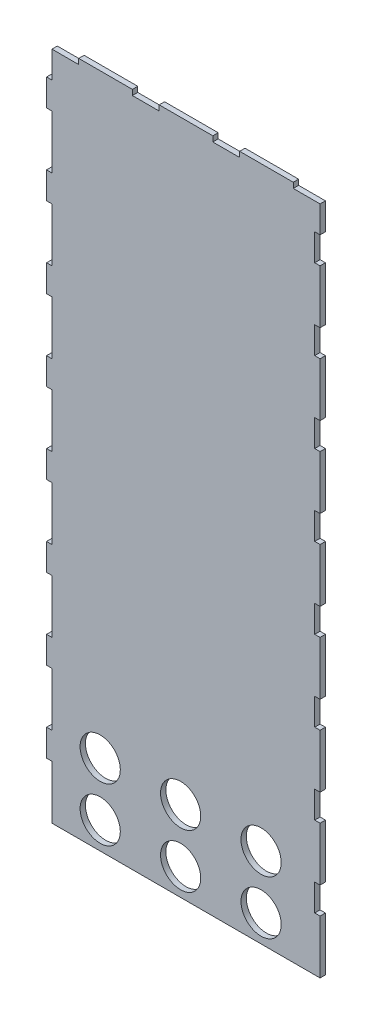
ISO-10303-21;
HEADER;
FILE_DESCRIPTION(('STEP AP214'),'2;1');
FILE_NAME('part.step','',(''),(''),'','','');
FILE_SCHEMA(('AUTOMOTIVE_DESIGN { 1 0 10303 214 1 1 1 1 }'));
ENDSEC;
DATA;
#1=APPLICATION_CONTEXT('core data for automotive mechanical design processes');
#2=APPLICATION_PROTOCOL_DEFINITION('international standard','automotive_design',2000,#1);
#3=PRODUCT_CONTEXT('',#1,'mechanical');
#4=PRODUCT('Part','Part','',(#3));
#5=PRODUCT_RELATED_PRODUCT_CATEGORY('part','',(#4));
#6=PRODUCT_DEFINITION_FORMATION('','',#4);
#7=PRODUCT_DEFINITION_CONTEXT('part definition',#1,'design');
#8=PRODUCT_DEFINITION('design','',#6,#7);
#9=PRODUCT_DEFINITION_SHAPE('','',#8);
#10=(LENGTH_UNIT() NAMED_UNIT(*) SI_UNIT(.MILLI.,.METRE.));
#11=(NAMED_UNIT(*) PLANE_ANGLE_UNIT() SI_UNIT($,.RADIAN.));
#12=(NAMED_UNIT(*) SI_UNIT($,.STERADIAN.) SOLID_ANGLE_UNIT());
#13=UNCERTAINTY_MEASURE_WITH_UNIT(LENGTH_MEASURE(1.E-05),#10,'distance_accuracy_value','');
#14=(GEOMETRIC_REPRESENTATION_CONTEXT(3) GLOBAL_UNCERTAINTY_ASSIGNED_CONTEXT((#13)) GLOBAL_UNIT_ASSIGNED_CONTEXT((#10,
#11,#12)) REPRESENTATION_CONTEXT('',''));
#15=CARTESIAN_POINT('',(0.,0.,0.));
#16=DIRECTION('',(0.,0.,1.));
#17=DIRECTION('',(1.,0.,0.));
#18=AXIS2_PLACEMENT_3D('',#15,#16,#17);
#19=CARTESIAN_POINT('',(-50.,125.,2.));
#20=DIRECTION('',(0.,-1.,0.));
#21=DIRECTION('',(0.,0.,-1.));
#22=AXIS2_PLACEMENT_3D('',#19,#20,#21);
#23=PLANE('',#22);
#24=DIRECTION('',(0.,0.,1.));
#25=VECTOR('',#24,1.);
#26=CARTESIAN_POINT('',(20.,125.,0.));
#27=LINE('',#26,#25);
#28=CARTESIAN_POINT('',(20.,125.,0.));
#29=VERTEX_POINT('',#28);
#30=CARTESIAN_POINT('',(20.,125.,2.));
#31=VERTEX_POINT('',#30);
#32=EDGE_CURVE('E555',#29,#31,#27,.T.);
#33=ORIENTED_EDGE('',*,*,#32,.F.);
#34=DIRECTION('',(-1.,0.,0.));
#35=VECTOR('',#34,1.);
#36=CARTESIAN_POINT('',(-50.,125.,0.));
#37=LINE('',#36,#35);
#38=CARTESIAN_POINT('',(9.99999999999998,125.,0.));
#39=VERTEX_POINT('',#38);
#40=EDGE_CURVE('E1100',#29,#39,#37,.T.);
#41=ORIENTED_EDGE('',*,*,#40,.T.);
#42=DIRECTION('',(0.,0.,-1.));
#43=VECTOR('',#42,1.);
#44=CARTESIAN_POINT('',(9.99999999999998,125.,0.));
#45=LINE('',#44,#43);
#46=CARTESIAN_POINT('',(9.99999999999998,125.,2.));
#47=VERTEX_POINT('',#46);
#48=EDGE_CURVE('E559',#47,#39,#45,.T.);
#49=ORIENTED_EDGE('',*,*,#48,.F.);
#50=DIRECTION('',(-1.,0.,0.));
#51=VECTOR('',#50,1.);
#52=CARTESIAN_POINT('',(-50.,125.,2.));
#53=LINE('',#52,#51);
#54=EDGE_CURVE('E49',#31,#47,#53,.T.);
#55=ORIENTED_EDGE('',*,*,#54,.F.);
#56=EDGE_LOOP('',(#33,#41,#49,#55));
#57=FACE_BOUND('',#56,.T.);
#58=ADVANCED_FACE('F34',(#57),#23,.F.);
#59=DIRECTION('',(0.,0.,-1.));
#60=VECTOR('',#59,1.);
#61=CARTESIAN_POINT('',(40.,125.,0.));
#62=LINE('',#61,#60);
#63=CARTESIAN_POINT('',(40.,125.,2.));
#64=VERTEX_POINT('',#63);
#65=CARTESIAN_POINT('',(40.,125.,0.));
#66=VERTEX_POINT('',#65);
#67=EDGE_CURVE('E57',#64,#66,#62,.T.);
#68=ORIENTED_EDGE('',*,*,#67,.F.);
#69=CARTESIAN_POINT('',(50.,125.,2.));
#70=VERTEX_POINT('',#69);
#71=EDGE_CURVE('E1082',#70,#64,#53,.T.);
#72=ORIENTED_EDGE('',*,*,#71,.F.);
#73=DIRECTION('',(0.,0.,-1.));
#74=VECTOR('',#73,1.);
#75=CARTESIAN_POINT('',(50.,125.,2.));
#76=LINE('',#75,#74);
#77=CARTESIAN_POINT('',(50.,125.,0.));
#78=VERTEX_POINT('',#77);
#79=EDGE_CURVE('E11',#70,#78,#76,.T.);
#80=ORIENTED_EDGE('',*,*,#79,.T.);
#81=EDGE_CURVE('E1097',#78,#66,#37,.T.);
#82=ORIENTED_EDGE('',*,*,#81,.T.);
#83=EDGE_LOOP('',(#68,#72,#80,#82));
#84=FACE_BOUND('',#83,.T.);
#85=ADVANCED_FACE('F1167',(#84),#23,.F.);
#86=DIRECTION('',(0.,0.,1.));
#87=VECTOR('',#86,1.);
#88=CARTESIAN_POINT('',(-10.,125.,0.));
#89=LINE('',#88,#87);
#90=CARTESIAN_POINT('',(-10.,125.,0.));
#91=VERTEX_POINT('',#90);
#92=CARTESIAN_POINT('',(-10.,125.,2.));
#93=VERTEX_POINT('',#92);
#94=EDGE_CURVE('E556',#91,#93,#89,.T.);
#95=ORIENTED_EDGE('',*,*,#94,.F.);
#96=CARTESIAN_POINT('',(-20.,125.,0.));
#97=VERTEX_POINT('',#96);
#98=EDGE_CURVE('E1148',#91,#97,#37,.T.);
#99=ORIENTED_EDGE('',*,*,#98,.T.);
#100=DIRECTION('',(0.,0.,-1.));
#101=VECTOR('',#100,1.);
#102=CARTESIAN_POINT('',(-20.,125.,0.));
#103=LINE('',#102,#101);
#104=CARTESIAN_POINT('',(-20.,125.,2.));
#105=VERTEX_POINT('',#104);
#106=EDGE_CURVE('E593',#105,#97,#103,.T.);
#107=ORIENTED_EDGE('',*,*,#106,.F.);
#108=EDGE_CURVE('E1129',#93,#105,#53,.T.);
#109=ORIENTED_EDGE('',*,*,#108,.F.);
#110=EDGE_LOOP('',(#95,#99,#107,#109));
#111=FACE_BOUND('',#110,.T.);
#112=ADVANCED_FACE('F1147',(#111),#23,.F.);
#113=DIRECTION('',(0.,0.,1.));
#114=VECTOR('',#113,1.);
#115=CARTESIAN_POINT('',(-40.,125.,0.));
#116=LINE('',#115,#114);
#117=CARTESIAN_POINT('',(-40.,125.,0.));
#118=VERTEX_POINT('',#117);
#119=CARTESIAN_POINT('',(-40.,125.,2.));
#120=VERTEX_POINT('',#119);
#121=EDGE_CURVE('E588',#118,#120,#116,.T.);
#122=ORIENTED_EDGE('',*,*,#121,.F.);
#123=CARTESIAN_POINT('',(-50.,125.,0.));
#124=VERTEX_POINT('',#123);
#125=EDGE_CURVE('E1095',#118,#124,#37,.T.);
#126=ORIENTED_EDGE('',*,*,#125,.T.);
#127=DIRECTION('',(0.,0.,-1.));
#128=VECTOR('',#127,1.);
#129=CARTESIAN_POINT('',(-50.,125.,2.));
#130=LINE('',#129,#128);
#131=CARTESIAN_POINT('',(-50.,125.,2.));
#132=VERTEX_POINT('',#131);
#133=EDGE_CURVE('E42',#132,#124,#130,.T.);
#134=ORIENTED_EDGE('',*,*,#133,.F.);
#135=EDGE_CURVE('E1079',#120,#132,#53,.T.);
#136=ORIENTED_EDGE('',*,*,#135,.F.);
#137=EDGE_LOOP('',(#122,#126,#134,#136));
#138=FACE_BOUND('',#137,.T.);
#139=ADVANCED_FACE('F1159',(#138),#23,.F.);
#140=CARTESIAN_POINT('',(0.,0.,2.));
#141=DIRECTION('',(0.,0.,1.));
#142=DIRECTION('',(1.,0.,0.));
#143=AXIS2_PLACEMENT_3D('',#140,#141,#142);
#144=PLANE('',#143);
#145=CARTESIAN_POINT('',(28.0000000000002,-115.,2.));
#146=DIRECTION('',(0.,0.,1.));
#147=DIRECTION('',(1.,0.,0.));
#148=AXIS2_PLACEMENT_3D('',#145,#146,#147);
#149=CIRCLE('',#148,7.5);
#150=CARTESIAN_POINT('',(35.5000000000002,-115.,2.));
#151=VERTEX_POINT('',#150);
#152=EDGE_CURVE('E1046',#151,#151,#149,.T.);
#153=ORIENTED_EDGE('',*,*,#152,.F.);
#154=EDGE_LOOP('',(#153));
#155=FACE_BOUND('',#154,.T.);
#156=CARTESIAN_POINT('',(28.,-95.,2.));
#157=DIRECTION('',(0.,0.,1.));
#158=DIRECTION('',(1.,0.,0.));
#159=AXIS2_PLACEMENT_3D('',#156,#157,#158);
#160=CIRCLE('',#159,7.5);
#161=CARTESIAN_POINT('',(35.5,-95.,2.));
#162=VERTEX_POINT('',#161);
#163=EDGE_CURVE('E1058',#162,#162,#160,.T.);
#164=ORIENTED_EDGE('',*,*,#163,.F.);
#165=EDGE_LOOP('',(#164));
#166=FACE_BOUND('',#165,.T.);
#167=CARTESIAN_POINT('',(-32.,-95.,2.));
#168=DIRECTION('',(0.,0.,1.));
#169=DIRECTION('',(1.,0.,0.));
#170=AXIS2_PLACEMENT_3D('',#167,#168,#169);
#171=CIRCLE('',#170,7.5);
#172=CARTESIAN_POINT('',(-24.5,-95.,2.));
#173=VERTEX_POINT('',#172);
#174=EDGE_CURVE('E1070',#173,#173,#171,.T.);
#175=ORIENTED_EDGE('',*,*,#174,.F.);
#176=EDGE_LOOP('',(#175));
#177=FACE_BOUND('',#176,.T.);
#178=CARTESIAN_POINT('',(-2.,-95.,2.));
#179=DIRECTION('',(0.,0.,1.));
#180=DIRECTION('',(1.,0.,0.));
#181=AXIS2_PLACEMENT_3D('',#178,#179,#180);
#182=CIRCLE('',#181,7.5);
#183=CARTESIAN_POINT('',(5.5,-95.,2.));
#184=VERTEX_POINT('',#183);
#185=EDGE_CURVE('E1064',#184,#184,#182,.T.);
#186=ORIENTED_EDGE('',*,*,#185,.F.);
#187=EDGE_LOOP('',(#186));
#188=FACE_BOUND('',#187,.T.);
#189=CARTESIAN_POINT('',(-1.99999999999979,-115.,2.));
#190=DIRECTION('',(0.,0.,1.));
#191=DIRECTION('',(1.,0.,0.));
#192=AXIS2_PLACEMENT_3D('',#189,#190,#191);
#193=CIRCLE('',#192,7.5);
#194=CARTESIAN_POINT('',(5.50000000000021,-115.,2.));
#195=VERTEX_POINT('',#194);
#196=EDGE_CURVE('E1052',#195,#195,#193,.T.);
#197=ORIENTED_EDGE('',*,*,#196,.F.);
#198=EDGE_LOOP('',(#197));
#199=FACE_BOUND('',#198,.T.);
#200=CARTESIAN_POINT('',(-31.9999999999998,-115.,2.));
#201=DIRECTION('',(0.,0.,1.));
#202=DIRECTION('',(1.,0.,0.));
#203=AXIS2_PLACEMENT_3D('',#200,#201,#202);
#204=CIRCLE('',#203,7.5);
#205=CARTESIAN_POINT('',(-24.4999999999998,-115.,2.));
#206=VERTEX_POINT('',#205);
#207=EDGE_CURVE('E1040',#206,#206,#204,.T.);
#208=ORIENTED_EDGE('',*,*,#207,.F.);
#209=EDGE_LOOP('',(#208));
#210=FACE_BOUND('',#209,.T.);
#211=DIRECTION('',(0.,1.,0.));
#212=VECTOR('',#211,1.);
#213=CARTESIAN_POINT('',(50.,125.,2.));
#214=LINE('',#213,#212);
#215=CARTESIAN_POINT('',(50.,-65.,2.));
#216=VERTEX_POINT('',#215);
#217=CARTESIAN_POINT('',(50.,-45.,2.));
#218=VERTEX_POINT('',#217);
#219=EDGE_CURVE('E1533',#216,#218,#214,.T.);
#220=ORIENTED_EDGE('',*,*,#219,.T.);
#221=DIRECTION('',(1.,0.,0.));
#222=VECTOR('',#221,1.);
#223=CARTESIAN_POINT('',(48.,-45.,2.));
#224=LINE('',#223,#222);
#225=CARTESIAN_POINT('',(48.,-45.,2.));
#226=VERTEX_POINT('',#225);
#227=EDGE_CURVE('E703',#226,#218,#224,.T.);
#228=ORIENTED_EDGE('',*,*,#227,.F.);
#229=DIRECTION('',(0.,-1.,0.));
#230=VECTOR('',#229,1.);
#231=CARTESIAN_POINT('',(48.,0.,2.));
#232=LINE('',#231,#230);
#233=CARTESIAN_POINT('',(48.,-35.,2.));
#234=VERTEX_POINT('',#233);
#235=EDGE_CURVE('E697',#234,#226,#232,.T.);
#236=ORIENTED_EDGE('',*,*,#235,.F.);
#237=DIRECTION('',(1.,0.,0.));
#238=VECTOR('',#237,1.);
#239=CARTESIAN_POINT('',(48.,-35.,2.));
#240=LINE('',#239,#238);
#241=CARTESIAN_POINT('',(50.,-35.,2.));
#242=VERTEX_POINT('',#241);
#243=EDGE_CURVE('E700',#234,#242,#240,.T.);
#244=ORIENTED_EDGE('',*,*,#243,.T.);
#245=CARTESIAN_POINT('',(50.,-15.,2.));
#246=VERTEX_POINT('',#245);
#247=EDGE_CURVE('E1534',#242,#246,#214,.T.);
#248=ORIENTED_EDGE('',*,*,#247,.T.);
#249=DIRECTION('',(1.,0.,0.));
#250=VECTOR('',#249,1.);
#251=CARTESIAN_POINT('',(48.,-15.,2.));
#252=LINE('',#251,#250);
#253=CARTESIAN_POINT('',(48.,-15.,2.));
#254=VERTEX_POINT('',#253);
#255=EDGE_CURVE('E731',#254,#246,#252,.T.);
#256=ORIENTED_EDGE('',*,*,#255,.F.);
#257=DIRECTION('',(0.,-1.,0.));
#258=VECTOR('',#257,1.);
#259=CARTESIAN_POINT('',(48.,0.,2.));
#260=LINE('',#259,#258);
#261=CARTESIAN_POINT('',(48.,-4.99999999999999,2.));
#262=VERTEX_POINT('',#261);
#263=EDGE_CURVE('E725',#262,#254,#260,.T.);
#264=ORIENTED_EDGE('',*,*,#263,.F.);
#265=DIRECTION('',(1.,0.,0.));
#266=VECTOR('',#265,1.);
#267=CARTESIAN_POINT('',(48.,-4.99999999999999,2.));
#268=LINE('',#267,#266);
#269=CARTESIAN_POINT('',(50.,-4.99999999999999,2.));
#270=VERTEX_POINT('',#269);
#271=EDGE_CURVE('E728',#262,#270,#268,.T.);
#272=ORIENTED_EDGE('',*,*,#271,.T.);
#273=CARTESIAN_POINT('',(50.,15.,2.));
#274=VERTEX_POINT('',#273);
#275=EDGE_CURVE('E1538',#270,#274,#214,.T.);
#276=ORIENTED_EDGE('',*,*,#275,.T.);
#277=DIRECTION('',(1.,0.,0.));
#278=VECTOR('',#277,1.);
#279=CARTESIAN_POINT('',(48.,15.,2.));
#280=LINE('',#279,#278);
#281=CARTESIAN_POINT('',(48.,15.,2.));
#282=VERTEX_POINT('',#281);
#283=EDGE_CURVE('E757',#282,#274,#280,.T.);
#284=ORIENTED_EDGE('',*,*,#283,.F.);
#285=DIRECTION('',(0.,-1.,0.));
#286=VECTOR('',#285,1.);
#287=CARTESIAN_POINT('',(48.,0.,2.));
#288=LINE('',#287,#286);
#289=CARTESIAN_POINT('',(48.,25.,2.));
#290=VERTEX_POINT('',#289);
#291=EDGE_CURVE('E751',#290,#282,#288,.T.);
#292=ORIENTED_EDGE('',*,*,#291,.F.);
#293=DIRECTION('',(1.,0.,0.));
#294=VECTOR('',#293,1.);
#295=CARTESIAN_POINT('',(48.,25.,2.));
#296=LINE('',#295,#294);
#297=CARTESIAN_POINT('',(50.,25.,2.));
#298=VERTEX_POINT('',#297);
#299=EDGE_CURVE('E754',#290,#298,#296,.T.);
#300=ORIENTED_EDGE('',*,*,#299,.T.);
#301=CARTESIAN_POINT('',(50.,45.,2.));
#302=VERTEX_POINT('',#301);
#303=EDGE_CURVE('E1542',#298,#302,#214,.T.);
#304=ORIENTED_EDGE('',*,*,#303,.T.);
#305=DIRECTION('',(1.,0.,0.));
#306=VECTOR('',#305,1.);
#307=CARTESIAN_POINT('',(48.,45.,2.));
#308=LINE('',#307,#306);
#309=CARTESIAN_POINT('',(48.,45.,2.));
#310=VERTEX_POINT('',#309);
#311=EDGE_CURVE('E635',#310,#302,#308,.T.);
#312=ORIENTED_EDGE('',*,*,#311,.F.);
#313=DIRECTION('',(0.,-1.,0.));
#314=VECTOR('',#313,1.);
#315=CARTESIAN_POINT('',(48.,0.,2.));
#316=LINE('',#315,#314);
#317=CARTESIAN_POINT('',(48.,55.,2.));
#318=VERTEX_POINT('',#317);
#319=EDGE_CURVE('E777',#318,#310,#316,.T.);
#320=ORIENTED_EDGE('',*,*,#319,.F.);
#321=DIRECTION('',(1.,0.,0.));
#322=VECTOR('',#321,1.);
#323=CARTESIAN_POINT('',(48.,55.,2.));
#324=LINE('',#323,#322);
#325=CARTESIAN_POINT('',(50.,55.,2.));
#326=VERTEX_POINT('',#325);
#327=EDGE_CURVE('E780',#318,#326,#324,.T.);
#328=ORIENTED_EDGE('',*,*,#327,.T.);
#329=CARTESIAN_POINT('',(50.,75.,2.));
#330=VERTEX_POINT('',#329);
#331=EDGE_CURVE('E1546',#326,#330,#214,.T.);
#332=ORIENTED_EDGE('',*,*,#331,.T.);
#333=DIRECTION('',(1.,0.,0.));
#334=VECTOR('',#333,1.);
#335=CARTESIAN_POINT('',(48.,75.,2.));
#336=LINE('',#335,#334);
#337=CARTESIAN_POINT('',(48.,75.,2.));
#338=VERTEX_POINT('',#337);
#339=EDGE_CURVE('E620',#338,#330,#336,.T.);
#340=ORIENTED_EDGE('',*,*,#339,.F.);
#341=DIRECTION('',(0.,-1.,0.));
#342=VECTOR('',#341,1.);
#343=CARTESIAN_POINT('',(48.,0.,2.));
#344=LINE('',#343,#342);
#345=CARTESIAN_POINT('',(48.,85.,2.));
#346=VERTEX_POINT('',#345);
#347=EDGE_CURVE('E640',#346,#338,#344,.T.);
#348=ORIENTED_EDGE('',*,*,#347,.F.);
#349=DIRECTION('',(1.,0.,0.));
#350=VECTOR('',#349,1.);
#351=CARTESIAN_POINT('',(48.,85.,2.));
#352=LINE('',#351,#350);
#353=CARTESIAN_POINT('',(50.,85.,2.));
#354=VERTEX_POINT('',#353);
#355=EDGE_CURVE('E616',#346,#354,#352,.T.);
#356=ORIENTED_EDGE('',*,*,#355,.T.);
#357=CARTESIAN_POINT('',(50.,105.,2.));
#358=VERTEX_POINT('',#357);
#359=EDGE_CURVE('E1550',#354,#358,#214,.T.);
#360=ORIENTED_EDGE('',*,*,#359,.T.);
#361=DIRECTION('',(1.,0.,0.));
#362=VECTOR('',#361,1.);
#363=CARTESIAN_POINT('',(48.,105.,2.));
#364=LINE('',#363,#362);
#365=CARTESIAN_POINT('',(48.,105.,2.));
#366=VERTEX_POINT('',#365);
#367=EDGE_CURVE('E648',#366,#358,#364,.T.);
#368=ORIENTED_EDGE('',*,*,#367,.F.);
#369=DIRECTION('',(0.,-1.,0.));
#370=VECTOR('',#369,1.);
#371=CARTESIAN_POINT('',(48.,0.,2.));
#372=LINE('',#371,#370);
#373=CARTESIAN_POINT('',(48.,115.,2.));
#374=VERTEX_POINT('',#373);
#375=EDGE_CURVE('E666',#374,#366,#372,.T.);
#376=ORIENTED_EDGE('',*,*,#375,.F.);
#377=DIRECTION('',(1.,0.,0.));
#378=VECTOR('',#377,1.);
#379=CARTESIAN_POINT('',(48.,115.,2.));
#380=LINE('',#379,#378);
#381=CARTESIAN_POINT('',(50.,115.,2.));
#382=VERTEX_POINT('',#381);
#383=EDGE_CURVE('E644',#374,#382,#380,.T.);
#384=ORIENTED_EDGE('',*,*,#383,.T.);
#385=EDGE_CURVE('E1081',#382,#70,#214,.T.);
#386=ORIENTED_EDGE('',*,*,#385,.T.);
#387=ORIENTED_EDGE('',*,*,#71,.T.);
#388=DIRECTION('',(0.,-1.,0.));
#389=VECTOR('',#388,1.);
#390=CARTESIAN_POINT('',(40.,127.,2.));
#391=LINE('',#390,#389);
#392=CARTESIAN_POINT('',(40.,127.,2.));
#393=VERTEX_POINT('',#392);
#394=EDGE_CURVE('E540',#393,#64,#391,.T.);
#395=ORIENTED_EDGE('',*,*,#394,.F.);
#396=DIRECTION('',(1.,0.,0.));
#397=VECTOR('',#396,1.);
#398=CARTESIAN_POINT('',(20.,127.,2.));
#399=LINE('',#398,#397);
#400=CARTESIAN_POINT('',(20.,127.,2.));
#401=VERTEX_POINT('',#400);
#402=EDGE_CURVE('E532',#401,#393,#399,.T.);
#403=ORIENTED_EDGE('',*,*,#402,.F.);
#404=DIRECTION('',(0.,-1.,0.));
#405=VECTOR('',#404,1.);
#406=CARTESIAN_POINT('',(20.,127.,2.));
#407=LINE('',#406,#405);
#408=EDGE_CURVE('E537',#401,#31,#407,.T.);
#409=ORIENTED_EDGE('',*,*,#408,.T.);
#410=ORIENTED_EDGE('',*,*,#54,.T.);
#411=DIRECTION('',(0.,-1.,0.));
#412=VECTOR('',#411,1.);
#413=CARTESIAN_POINT('',(9.99999999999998,127.,2.));
#414=LINE('',#413,#412);
#415=CARTESIAN_POINT('',(9.99999999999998,127.,2.));
#416=VERTEX_POINT('',#415);
#417=EDGE_CURVE('E582',#416,#47,#414,.T.);
#418=ORIENTED_EDGE('',*,*,#417,.F.);
#419=DIRECTION('',(1.,0.,0.));
#420=VECTOR('',#419,1.);
#421=CARTESIAN_POINT('',(-10.,127.,2.));
#422=LINE('',#421,#420);
#423=CARTESIAN_POINT('',(-10.,127.,2.));
#424=VERTEX_POINT('',#423);
#425=EDGE_CURVE('E568',#424,#416,#422,.T.);
#426=ORIENTED_EDGE('',*,*,#425,.F.);
#427=DIRECTION('',(0.,-1.,0.));
#428=VECTOR('',#427,1.);
#429=CARTESIAN_POINT('',(-10.,127.,2.));
#430=LINE('',#429,#428);
#431=EDGE_CURVE('E585',#424,#93,#430,.T.);
#432=ORIENTED_EDGE('',*,*,#431,.T.);
#433=ORIENTED_EDGE('',*,*,#108,.T.);
#434=DIRECTION('',(0.,-1.,0.));
#435=VECTOR('',#434,1.);
#436=CARTESIAN_POINT('',(-20.,127.,2.));
#437=LINE('',#436,#435);
#438=CARTESIAN_POINT('',(-20.,127.,2.));
#439=VERTEX_POINT('',#438);
#440=EDGE_CURVE('E609',#439,#105,#437,.T.);
#441=ORIENTED_EDGE('',*,*,#440,.F.);
#442=DIRECTION('',(1.,0.,0.));
#443=VECTOR('',#442,1.);
#444=CARTESIAN_POINT('',(-40.,127.,2.));
#445=LINE('',#444,#443);
#446=CARTESIAN_POINT('',(-40.,127.,2.));
#447=VERTEX_POINT('',#446);
#448=EDGE_CURVE('E592',#447,#439,#445,.T.);
#449=ORIENTED_EDGE('',*,*,#448,.F.);
#450=DIRECTION('',(0.,-1.,0.));
#451=VECTOR('',#450,1.);
#452=CARTESIAN_POINT('',(-40.,127.,2.));
#453=LINE('',#452,#451);
#454=EDGE_CURVE('E612',#447,#120,#453,.T.);
#455=ORIENTED_EDGE('',*,*,#454,.T.);
#456=ORIENTED_EDGE('',*,*,#135,.T.);
#457=DIRECTION('',(0.,-1.,0.));
#458=VECTOR('',#457,1.);
#459=CARTESIAN_POINT('',(-50.,125.,2.));
#460=LINE('',#459,#458);
#461=CARTESIAN_POINT('',(-50.,115.,2.));
#462=VERTEX_POINT('',#461);
#463=EDGE_CURVE('E1085',#132,#462,#460,.T.);
#464=ORIENTED_EDGE('',*,*,#463,.T.);
#465=DIRECTION('',(1.,0.,0.));
#466=VECTOR('',#465,1.);
#467=CARTESIAN_POINT('',(-52.,115.,2.));
#468=LINE('',#467,#466);
#469=CARTESIAN_POINT('',(-52.,115.,2.));
#470=VERTEX_POINT('',#469);
#471=EDGE_CURVE('E1036',#470,#462,#468,.T.);
#472=ORIENTED_EDGE('',*,*,#471,.F.);
#473=DIRECTION('',(0.,1.,0.));
#474=VECTOR('',#473,1.);
#475=CARTESIAN_POINT('',(-52.,115.,2.));
#476=LINE('',#475,#474);
#477=CARTESIAN_POINT('',(-52.,105.,2.));
#478=VERTEX_POINT('',#477);
#479=EDGE_CURVE('E1013',#478,#470,#476,.T.);
#480=ORIENTED_EDGE('',*,*,#479,.F.);
#481=DIRECTION('',(1.,0.,0.));
#482=VECTOR('',#481,1.);
#483=CARTESIAN_POINT('',(-52.,105.,2.));
#484=LINE('',#483,#482);
#485=CARTESIAN_POINT('',(-50.,105.,2.));
#486=VERTEX_POINT('',#485);
#487=EDGE_CURVE('E1023',#478,#486,#484,.T.);
#488=ORIENTED_EDGE('',*,*,#487,.T.);
#489=CARTESIAN_POINT('',(-50.,85.,2.));
#490=VERTEX_POINT('',#489);
#491=EDGE_CURVE('E1089',#486,#490,#460,.T.);
#492=ORIENTED_EDGE('',*,*,#491,.T.);
#493=DIRECTION('',(1.,0.,0.));
#494=VECTOR('',#493,1.);
#495=CARTESIAN_POINT('',(-52.,85.,2.));
#496=LINE('',#495,#494);
#497=CARTESIAN_POINT('',(-52.,85.,2.));
#498=VERTEX_POINT('',#497);
#499=EDGE_CURVE('E1009',#498,#490,#496,.T.);
#500=ORIENTED_EDGE('',*,*,#499,.F.);
#501=DIRECTION('',(0.,1.,0.));
#502=VECTOR('',#501,1.);
#503=CARTESIAN_POINT('',(-52.,85.,2.));
#504=LINE('',#503,#502);
#505=CARTESIAN_POINT('',(-52.,75.,2.));
#506=VERTEX_POINT('',#505);
#507=EDGE_CURVE('E986',#506,#498,#504,.T.);
#508=ORIENTED_EDGE('',*,*,#507,.F.);
#509=DIRECTION('',(1.,0.,0.));
#510=VECTOR('',#509,1.);
#511=CARTESIAN_POINT('',(-52.,75.,2.));
#512=LINE('',#511,#510);
#513=CARTESIAN_POINT('',(-50.,75.,2.));
#514=VERTEX_POINT('',#513);
#515=EDGE_CURVE('E996',#506,#514,#512,.T.);
#516=ORIENTED_EDGE('',*,*,#515,.T.);
#517=CARTESIAN_POINT('',(-50.,55.,2.));
#518=VERTEX_POINT('',#517);
#519=EDGE_CURVE('E2152',#514,#518,#460,.T.);
#520=ORIENTED_EDGE('',*,*,#519,.T.);
#521=DIRECTION('',(1.,0.,0.));
#522=VECTOR('',#521,1.);
#523=CARTESIAN_POINT('',(-52.,55.,2.));
#524=LINE('',#523,#522);
#525=CARTESIAN_POINT('',(-52.,55.,2.));
#526=VERTEX_POINT('',#525);
#527=EDGE_CURVE('E982',#526,#518,#524,.T.);
#528=ORIENTED_EDGE('',*,*,#527,.F.);
#529=DIRECTION('',(0.,1.,0.));
#530=VECTOR('',#529,1.);
#531=CARTESIAN_POINT('',(-52.,55.,2.));
#532=LINE('',#531,#530);
#533=CARTESIAN_POINT('',(-52.,45.,2.));
#534=VERTEX_POINT('',#533);
#535=EDGE_CURVE('E959',#534,#526,#532,.T.);
#536=ORIENTED_EDGE('',*,*,#535,.F.);
#537=DIRECTION('',(1.,0.,0.));
#538=VECTOR('',#537,1.);
#539=CARTESIAN_POINT('',(-52.,45.,2.));
#540=LINE('',#539,#538);
#541=CARTESIAN_POINT('',(-50.,45.,2.));
#542=VERTEX_POINT('',#541);
#543=EDGE_CURVE('E969',#534,#542,#540,.T.);
#544=ORIENTED_EDGE('',*,*,#543,.T.);
#545=CARTESIAN_POINT('',(-50.,25.,2.));
#546=VERTEX_POINT('',#545);
#547=EDGE_CURVE('E2154',#542,#546,#460,.T.);
#548=ORIENTED_EDGE('',*,*,#547,.T.);
#549=DIRECTION('',(1.,0.,0.));
#550=VECTOR('',#549,1.);
#551=CARTESIAN_POINT('',(-52.,25.,2.));
#552=LINE('',#551,#550);
#553=CARTESIAN_POINT('',(-52.,25.,2.));
#554=VERTEX_POINT('',#553);
#555=EDGE_CURVE('E955',#554,#546,#552,.T.);
#556=ORIENTED_EDGE('',*,*,#555,.F.);
#557=DIRECTION('',(0.,1.,0.));
#558=VECTOR('',#557,1.);
#559=CARTESIAN_POINT('',(-52.,25.,2.));
#560=LINE('',#559,#558);
#561=CARTESIAN_POINT('',(-52.,15.,2.));
#562=VERTEX_POINT('',#561);
#563=EDGE_CURVE('E932',#562,#554,#560,.T.);
#564=ORIENTED_EDGE('',*,*,#563,.F.);
#565=DIRECTION('',(1.,0.,0.));
#566=VECTOR('',#565,1.);
#567=CARTESIAN_POINT('',(-52.,15.,2.));
#568=LINE('',#567,#566);
#569=CARTESIAN_POINT('',(-50.,15.,2.));
#570=VERTEX_POINT('',#569);
#571=EDGE_CURVE('E942',#562,#570,#568,.T.);
#572=ORIENTED_EDGE('',*,*,#571,.T.);
#573=CARTESIAN_POINT('',(-50.,-5.00000000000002,2.));
#574=VERTEX_POINT('',#573);
#575=EDGE_CURVE('E2157',#570,#574,#460,.T.);
#576=ORIENTED_EDGE('',*,*,#575,.T.);
#577=DIRECTION('',(1.,0.,0.));
#578=VECTOR('',#577,1.);
#579=CARTESIAN_POINT('',(-52.,-5.,2.));
#580=LINE('',#579,#578);
#581=CARTESIAN_POINT('',(-52.,-5.,2.));
#582=VERTEX_POINT('',#581);
#583=EDGE_CURVE('E928',#582,#574,#580,.T.);
#584=ORIENTED_EDGE('',*,*,#583,.F.);
#585=DIRECTION('',(0.,1.,0.));
#586=VECTOR('',#585,1.);
#587=CARTESIAN_POINT('',(-52.,-5.,2.));
#588=LINE('',#587,#586);
#589=CARTESIAN_POINT('',(-52.,-15.,2.));
#590=VERTEX_POINT('',#589);
#591=EDGE_CURVE('E905',#590,#582,#588,.T.);
#592=ORIENTED_EDGE('',*,*,#591,.F.);
#593=DIRECTION('',(1.,0.,0.));
#594=VECTOR('',#593,1.);
#595=CARTESIAN_POINT('',(-52.,-15.,2.));
#596=LINE('',#595,#594);
#597=CARTESIAN_POINT('',(-50.,-15.,2.));
#598=VERTEX_POINT('',#597);
#599=EDGE_CURVE('E915',#590,#598,#596,.T.);
#600=ORIENTED_EDGE('',*,*,#599,.T.);
#601=CARTESIAN_POINT('',(-50.,-35.,2.));
#602=VERTEX_POINT('',#601);
#603=EDGE_CURVE('E2130',#598,#602,#460,.T.);
#604=ORIENTED_EDGE('',*,*,#603,.T.);
#605=DIRECTION('',(1.,0.,0.));
#606=VECTOR('',#605,1.);
#607=CARTESIAN_POINT('',(-52.,-35.,2.));
#608=LINE('',#607,#606);
#609=CARTESIAN_POINT('',(-52.,-35.,2.));
#610=VERTEX_POINT('',#609);
#611=EDGE_CURVE('E901',#610,#602,#608,.T.);
#612=ORIENTED_EDGE('',*,*,#611,.F.);
#613=DIRECTION('',(0.,1.,0.));
#614=VECTOR('',#613,1.);
#615=CARTESIAN_POINT('',(-52.,-35.,2.));
#616=LINE('',#615,#614);
#617=CARTESIAN_POINT('',(-52.,-45.,2.));
#618=VERTEX_POINT('',#617);
#619=EDGE_CURVE('E878',#618,#610,#616,.T.);
#620=ORIENTED_EDGE('',*,*,#619,.F.);
#621=DIRECTION('',(1.,0.,0.));
#622=VECTOR('',#621,1.);
#623=CARTESIAN_POINT('',(-52.,-45.,2.));
#624=LINE('',#623,#622);
#625=CARTESIAN_POINT('',(-50.,-45.,2.));
#626=VERTEX_POINT('',#625);
#627=EDGE_CURVE('E888',#618,#626,#624,.T.);
#628=ORIENTED_EDGE('',*,*,#627,.T.);
#629=CARTESIAN_POINT('',(-50.,-65.,2.));
#630=VERTEX_POINT('',#629);
#631=EDGE_CURVE('E1509',#626,#630,#460,.T.);
#632=ORIENTED_EDGE('',*,*,#631,.T.);
#633=DIRECTION('',(1.,0.,0.));
#634=VECTOR('',#633,1.);
#635=CARTESIAN_POINT('',(-52.,-65.,2.));
#636=LINE('',#635,#634);
#637=CARTESIAN_POINT('',(-52.,-65.,2.));
#638=VERTEX_POINT('',#637);
#639=EDGE_CURVE('E874',#638,#630,#636,.T.);
#640=ORIENTED_EDGE('',*,*,#639,.F.);
#641=DIRECTION('',(0.,1.,0.));
#642=VECTOR('',#641,1.);
#643=CARTESIAN_POINT('',(-52.,-65.,2.));
#644=LINE('',#643,#642);
#645=CARTESIAN_POINT('',(-52.,-75.,2.));
#646=VERTEX_POINT('',#645);
#647=EDGE_CURVE('E851',#646,#638,#644,.T.);
#648=ORIENTED_EDGE('',*,*,#647,.F.);
#649=DIRECTION('',(1.,0.,0.));
#650=VECTOR('',#649,1.);
#651=CARTESIAN_POINT('',(-52.,-75.,2.));
#652=LINE('',#651,#650);
#653=CARTESIAN_POINT('',(-50.,-75.,2.));
#654=VERTEX_POINT('',#653);
#655=EDGE_CURVE('E861',#646,#654,#652,.T.);
#656=ORIENTED_EDGE('',*,*,#655,.T.);
#657=CARTESIAN_POINT('',(-50.,-95.,2.));
#658=VERTEX_POINT('',#657);
#659=EDGE_CURVE('E1502',#654,#658,#460,.T.);
#660=ORIENTED_EDGE('',*,*,#659,.T.);
#661=DIRECTION('',(1.,0.,0.));
#662=VECTOR('',#661,1.);
#663=CARTESIAN_POINT('',(-52.,-95.,2.));
#664=LINE('',#663,#662);
#665=CARTESIAN_POINT('',(-52.,-95.,2.));
#666=VERTEX_POINT('',#665);
#667=EDGE_CURVE('E847',#666,#658,#664,.T.);
#668=ORIENTED_EDGE('',*,*,#667,.F.);
#669=DIRECTION('',(0.,1.,0.));
#670=VECTOR('',#669,1.);
#671=CARTESIAN_POINT('',(-52.,-95.,2.));
#672=LINE('',#671,#670);
#673=CARTESIAN_POINT('',(-52.,-105.,2.));
#674=VERTEX_POINT('',#673);
#675=EDGE_CURVE('E824',#674,#666,#672,.T.);
#676=ORIENTED_EDGE('',*,*,#675,.F.);
#677=DIRECTION('',(1.,0.,0.));
#678=VECTOR('',#677,1.);
#679=CARTESIAN_POINT('',(-52.,-105.,2.));
#680=LINE('',#679,#678);
#681=CARTESIAN_POINT('',(-50.,-105.,2.));
#682=VERTEX_POINT('',#681);
#683=EDGE_CURVE('E834',#674,#682,#680,.T.);
#684=ORIENTED_EDGE('',*,*,#683,.T.);
#685=CARTESIAN_POINT('',(-50.,-125.,2.));
#686=VERTEX_POINT('',#685);
#687=EDGE_CURVE('E1084',#682,#686,#460,.T.);
#688=ORIENTED_EDGE('',*,*,#687,.T.);
#689=DIRECTION('',(1.,0.,0.));
#690=VECTOR('',#689,1.);
#691=CARTESIAN_POINT('',(-50.,-125.,2.));
#692=LINE('',#691,#690);
#693=CARTESIAN_POINT('',(50.,-125.,2.));
#694=VERTEX_POINT('',#693);
#695=EDGE_CURVE('E1088',#686,#694,#692,.T.);
#696=ORIENTED_EDGE('',*,*,#695,.T.);
#697=CARTESIAN_POINT('',(50.,-105.,2.));
#698=VERTEX_POINT('',#697);
#699=EDGE_CURVE('E1076',#694,#698,#214,.T.);
#700=ORIENTED_EDGE('',*,*,#699,.T.);
#701=DIRECTION('',(1.,0.,0.));
#702=VECTOR('',#701,1.);
#703=CARTESIAN_POINT('',(48.,-105.,2.));
#704=LINE('',#703,#702);
#705=CARTESIAN_POINT('',(48.,-105.,2.));
#706=VERTEX_POINT('',#705);
#707=EDGE_CURVE('E672',#706,#698,#704,.T.);
#708=ORIENTED_EDGE('',*,*,#707,.F.);
#709=DIRECTION('',(0.,1.,0.));
#710=VECTOR('',#709,1.);
#711=CARTESIAN_POINT('',(48.,-105.,2.));
#712=LINE('',#711,#710);
#713=CARTESIAN_POINT('',(48.,-95.,2.));
#714=VERTEX_POINT('',#713);
#715=EDGE_CURVE('E687',#706,#714,#712,.T.);
#716=ORIENTED_EDGE('',*,*,#715,.T.);
#717=DIRECTION('',(1.,0.,0.));
#718=VECTOR('',#717,1.);
#719=CARTESIAN_POINT('',(48.,-95.,2.));
#720=LINE('',#719,#718);
#721=CARTESIAN_POINT('',(50.,-95.,2.));
#722=VERTEX_POINT('',#721);
#723=EDGE_CURVE('E674',#714,#722,#720,.T.);
#724=ORIENTED_EDGE('',*,*,#723,.T.);
#725=CARTESIAN_POINT('',(50.,-75.,2.));
#726=VERTEX_POINT('',#725);
#727=EDGE_CURVE('E1080',#722,#726,#214,.T.);
#728=ORIENTED_EDGE('',*,*,#727,.T.);
#729=DIRECTION('',(1.,0.,0.));
#730=VECTOR('',#729,1.);
#731=CARTESIAN_POINT('',(48.,-75.,2.));
#732=LINE('',#731,#730);
#733=CARTESIAN_POINT('',(48.,-75.,2.));
#734=VERTEX_POINT('',#733);
#735=EDGE_CURVE('E814',#734,#726,#732,.T.);
#736=ORIENTED_EDGE('',*,*,#735,.F.);
#737=DIRECTION('',(0.,-1.,0.));
#738=VECTOR('',#737,1.);
#739=CARTESIAN_POINT('',(48.,0.,2.));
#740=LINE('',#739,#738);
#741=CARTESIAN_POINT('',(48.,-65.,2.));
#742=VERTEX_POINT('',#741);
#743=EDGE_CURVE('E806',#742,#734,#740,.T.);
#744=ORIENTED_EDGE('',*,*,#743,.F.);
#745=DIRECTION('',(1.,0.,0.));
#746=VECTOR('',#745,1.);
#747=CARTESIAN_POINT('',(48.,-65.,2.));
#748=LINE('',#747,#746);
#749=EDGE_CURVE('E817',#742,#216,#748,.T.);
#750=ORIENTED_EDGE('',*,*,#749,.T.);
#751=EDGE_LOOP('',(#220,#228,#236,#244,#248,#256,#264,#272,#276,#284,#292,#300,#304,#312,#320,
#328,#332,#340,#348,#356,#360,#368,#376,#384,#386,#387,#395,#403,#409,#410,#418,#426,#432,#433,
#441,#449,#455,#456,#464,#472,#480,#488,#492,#500,#508,#516,#520,#528,#536,#544,#548,#556,#564,
#572,#576,#584,#592,#600,#604,#612,#620,#628,#632,#640,#648,#656,#660,#668,#676,#684,#688,#696,
#700,#708,#716,#724,#728,#736,#744,#750));
#752=FACE_BOUND('',#751,.T.);
#753=ADVANCED_FACE('F535',(#155,#166,#177,#188,#199,#210,#752),#144,.T.);
#754=CARTESIAN_POINT('',(0.,0.,0.));
#755=DIRECTION('',(0.,0.,1.));
#756=DIRECTION('',(1.,0.,0.));
#757=AXIS2_PLACEMENT_3D('',#754,#755,#756);
#758=PLANE('',#757);
#759=CARTESIAN_POINT('',(-32.,-95.,0.));
#760=DIRECTION('',(0.,0.,1.));
#761=DIRECTION('',(1.,0.,0.));
#762=AXIS2_PLACEMENT_3D('',#759,#760,#761);
#763=CIRCLE('',#762,7.5);
#764=CARTESIAN_POINT('',(-24.5,-95.,0.));
#765=VERTEX_POINT('',#764);
#766=EDGE_CURVE('E1067',#765,#765,#763,.T.);
#767=ORIENTED_EDGE('',*,*,#766,.T.);
#768=EDGE_LOOP('',(#767));
#769=FACE_BOUND('',#768,.T.);
#770=CARTESIAN_POINT('',(-2.,-95.,0.));
#771=DIRECTION('',(0.,0.,1.));
#772=DIRECTION('',(1.,0.,0.));
#773=AXIS2_PLACEMENT_3D('',#770,#771,#772);
#774=CIRCLE('',#773,7.5);
#775=CARTESIAN_POINT('',(5.5,-95.,0.));
#776=VERTEX_POINT('',#775);
#777=EDGE_CURVE('E1061',#776,#776,#774,.T.);
#778=ORIENTED_EDGE('',*,*,#777,.T.);
#779=EDGE_LOOP('',(#778));
#780=FACE_BOUND('',#779,.T.);
#781=CARTESIAN_POINT('',(28.,-95.,0.));
#782=DIRECTION('',(0.,0.,1.));
#783=DIRECTION('',(1.,0.,0.));
#784=AXIS2_PLACEMENT_3D('',#781,#782,#783);
#785=CIRCLE('',#784,7.5);
#786=CARTESIAN_POINT('',(35.5,-95.,0.));
#787=VERTEX_POINT('',#786);
#788=EDGE_CURVE('E1055',#787,#787,#785,.T.);
#789=ORIENTED_EDGE('',*,*,#788,.T.);
#790=EDGE_LOOP('',(#789));
#791=FACE_BOUND('',#790,.T.);
#792=CARTESIAN_POINT('',(-1.99999999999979,-115.,0.));
#793=DIRECTION('',(0.,0.,1.));
#794=DIRECTION('',(1.,0.,0.));
#795=AXIS2_PLACEMENT_3D('',#792,#793,#794);
#796=CIRCLE('',#795,7.5);
#797=CARTESIAN_POINT('',(5.50000000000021,-115.,0.));
#798=VERTEX_POINT('',#797);
#799=EDGE_CURVE('E1049',#798,#798,#796,.T.);
#800=ORIENTED_EDGE('',*,*,#799,.T.);
#801=EDGE_LOOP('',(#800));
#802=FACE_BOUND('',#801,.T.);
#803=CARTESIAN_POINT('',(28.0000000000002,-115.,0.));
#804=DIRECTION('',(0.,0.,1.));
#805=DIRECTION('',(1.,0.,0.));
#806=AXIS2_PLACEMENT_3D('',#803,#804,#805);
#807=CIRCLE('',#806,7.5);
#808=CARTESIAN_POINT('',(35.5000000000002,-115.,0.));
#809=VERTEX_POINT('',#808);
#810=EDGE_CURVE('E1043',#809,#809,#807,.T.);
#811=ORIENTED_EDGE('',*,*,#810,.T.);
#812=EDGE_LOOP('',(#811));
#813=FACE_BOUND('',#812,.T.);
#814=CARTESIAN_POINT('',(-31.9999999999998,-115.,0.));
#815=DIRECTION('',(0.,0.,1.));
#816=DIRECTION('',(1.,0.,0.));
#817=AXIS2_PLACEMENT_3D('',#814,#815,#816);
#818=CIRCLE('',#817,7.5);
#819=CARTESIAN_POINT('',(-24.4999999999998,-115.,0.));
#820=VERTEX_POINT('',#819);
#821=EDGE_CURVE('E1039',#820,#820,#818,.T.);
#822=ORIENTED_EDGE('',*,*,#821,.T.);
#823=EDGE_LOOP('',(#822));
#824=FACE_BOUND('',#823,.T.);
#825=DIRECTION('',(1.,0.,0.));
#826=VECTOR('',#825,1.);
#827=CARTESIAN_POINT('',(48.,-45.,0.));
#828=LINE('',#827,#826);
#829=CARTESIAN_POINT('',(48.,-45.,0.));
#830=VERTEX_POINT('',#829);
#831=CARTESIAN_POINT('',(50.,-45.,0.));
#832=VERTEX_POINT('',#831);
#833=EDGE_CURVE('E694',#830,#832,#828,.T.);
#834=ORIENTED_EDGE('',*,*,#833,.T.);
#835=DIRECTION('',(0.,1.,0.));
#836=VECTOR('',#835,1.);
#837=CARTESIAN_POINT('',(50.,125.,0.));
#838=LINE('',#837,#836);
#839=CARTESIAN_POINT('',(50.,-65.,0.));
#840=VERTEX_POINT('',#839);
#841=EDGE_CURVE('E1590',#840,#832,#838,.T.);
#842=ORIENTED_EDGE('',*,*,#841,.F.);
#843=DIRECTION('',(1.,0.,0.));
#844=VECTOR('',#843,1.);
#845=CARTESIAN_POINT('',(48.,-65.,0.));
#846=LINE('',#845,#844);
#847=CARTESIAN_POINT('',(48.,-65.,0.));
#848=VERTEX_POINT('',#847);
#849=EDGE_CURVE('E820',#848,#840,#846,.T.);
#850=ORIENTED_EDGE('',*,*,#849,.F.);
#851=DIRECTION('',(0.,1.,0.));
#852=VECTOR('',#851,1.);
#853=CARTESIAN_POINT('',(48.,0.,0.));
#854=LINE('',#853,#852);
#855=CARTESIAN_POINT('',(48.,-75.,0.));
#856=VERTEX_POINT('',#855);
#857=EDGE_CURVE('E800',#856,#848,#854,.T.);
#858=ORIENTED_EDGE('',*,*,#857,.F.);
#859=DIRECTION('',(1.,0.,0.));
#860=VECTOR('',#859,1.);
#861=CARTESIAN_POINT('',(48.,-75.,0.));
#862=LINE('',#861,#860);
#863=CARTESIAN_POINT('',(50.,-75.,0.));
#864=VERTEX_POINT('',#863);
#865=EDGE_CURVE('E809',#856,#864,#862,.T.);
#866=ORIENTED_EDGE('',*,*,#865,.T.);
#867=CARTESIAN_POINT('',(50.,-95.,0.));
#868=VERTEX_POINT('',#867);
#869=EDGE_CURVE('E1096',#868,#864,#838,.T.);
#870=ORIENTED_EDGE('',*,*,#869,.F.);
#871=DIRECTION('',(1.,0.,0.));
#872=VECTOR('',#871,1.);
#873=CARTESIAN_POINT('',(48.,-95.,0.));
#874=LINE('',#873,#872);
#875=CARTESIAN_POINT('',(48.,-95.,0.));
#876=VERTEX_POINT('',#875);
#877=EDGE_CURVE('E677',#876,#868,#874,.T.);
#878=ORIENTED_EDGE('',*,*,#877,.F.);
#879=DIRECTION('',(0.,-1.,0.));
#880=VECTOR('',#879,1.);
#881=CARTESIAN_POINT('',(48.,-95.,0.));
#882=LINE('',#881,#880);
#883=CARTESIAN_POINT('',(48.,-105.,0.));
#884=VERTEX_POINT('',#883);
#885=EDGE_CURVE('E683',#876,#884,#882,.T.);
#886=ORIENTED_EDGE('',*,*,#885,.T.);
#887=DIRECTION('',(1.,0.,0.));
#888=VECTOR('',#887,1.);
#889=CARTESIAN_POINT('',(48.,-105.,0.));
#890=LINE('',#889,#888);
#891=CARTESIAN_POINT('',(50.,-105.,0.));
#892=VERTEX_POINT('',#891);
#893=EDGE_CURVE('E615',#884,#892,#890,.T.);
#894=ORIENTED_EDGE('',*,*,#893,.T.);
#895=CARTESIAN_POINT('',(50.,-125.,0.));
#896=VERTEX_POINT('',#895);
#897=EDGE_CURVE('E1092',#896,#892,#838,.T.);
#898=ORIENTED_EDGE('',*,*,#897,.F.);
#899=DIRECTION('',(1.,0.,0.));
#900=VECTOR('',#899,1.);
#901=CARTESIAN_POINT('',(-50.,-125.,0.));
#902=LINE('',#901,#900);
#903=CARTESIAN_POINT('',(-50.,-125.,0.));
#904=VERTEX_POINT('',#903);
#905=EDGE_CURVE('E1103',#904,#896,#902,.T.);
#906=ORIENTED_EDGE('',*,*,#905,.F.);
#907=DIRECTION('',(0.,-1.,0.));
#908=VECTOR('',#907,1.);
#909=CARTESIAN_POINT('',(-50.,125.,0.));
#910=LINE('',#909,#908);
#911=CARTESIAN_POINT('',(-50.,-105.,0.));
#912=VERTEX_POINT('',#911);
#913=EDGE_CURVE('E1099',#912,#904,#910,.T.);
#914=ORIENTED_EDGE('',*,*,#913,.F.);
#915=DIRECTION('',(1.,0.,0.));
#916=VECTOR('',#915,1.);
#917=CARTESIAN_POINT('',(-52.,-105.,0.));
#918=LINE('',#917,#916);
#919=CARTESIAN_POINT('',(-52.,-105.,0.));
#920=VERTEX_POINT('',#919);
#921=EDGE_CURVE('E841',#920,#912,#918,.T.);
#922=ORIENTED_EDGE('',*,*,#921,.F.);
#923=DIRECTION('',(0.,-1.,0.));
#924=VECTOR('',#923,1.);
#925=CARTESIAN_POINT('',(-52.,-95.,0.));
#926=LINE('',#925,#924);
#927=CARTESIAN_POINT('',(-52.,-95.,0.));
#928=VERTEX_POINT('',#927);
#929=EDGE_CURVE('E830',#928,#920,#926,.T.);
#930=ORIENTED_EDGE('',*,*,#929,.F.);
#931=DIRECTION('',(1.,0.,0.));
#932=VECTOR('',#931,1.);
#933=CARTESIAN_POINT('',(-52.,-95.,0.));
#934=LINE('',#933,#932);
#935=CARTESIAN_POINT('',(-50.,-95.,0.));
#936=VERTEX_POINT('',#935);
#937=EDGE_CURVE('E844',#928,#936,#934,.T.);
#938=ORIENTED_EDGE('',*,*,#937,.T.);
#939=CARTESIAN_POINT('',(-50.,-75.,0.));
#940=VERTEX_POINT('',#939);
#941=EDGE_CURVE('E1503',#940,#936,#910,.T.);
#942=ORIENTED_EDGE('',*,*,#941,.F.);
#943=DIRECTION('',(1.,0.,0.));
#944=VECTOR('',#943,1.);
#945=CARTESIAN_POINT('',(-52.,-75.,0.));
#946=LINE('',#945,#944);
#947=CARTESIAN_POINT('',(-52.,-75.,0.));
#948=VERTEX_POINT('',#947);
#949=EDGE_CURVE('E868',#948,#940,#946,.T.);
#950=ORIENTED_EDGE('',*,*,#949,.F.);
#951=DIRECTION('',(0.,-1.,0.));
#952=VECTOR('',#951,1.);
#953=CARTESIAN_POINT('',(-52.,-65.,0.));
#954=LINE('',#953,#952);
#955=CARTESIAN_POINT('',(-52.,-65.,0.));
#956=VERTEX_POINT('',#955);
#957=EDGE_CURVE('E857',#956,#948,#954,.T.);
#958=ORIENTED_EDGE('',*,*,#957,.F.);
#959=DIRECTION('',(1.,0.,0.));
#960=VECTOR('',#959,1.);
#961=CARTESIAN_POINT('',(-52.,-65.,0.));
#962=LINE('',#961,#960);
#963=CARTESIAN_POINT('',(-50.,-65.,0.));
#964=VERTEX_POINT('',#963);
#965=EDGE_CURVE('E871',#956,#964,#962,.T.);
#966=ORIENTED_EDGE('',*,*,#965,.T.);
#967=CARTESIAN_POINT('',(-50.,-45.,0.));
#968=VERTEX_POINT('',#967);
#969=EDGE_CURVE('E2125',#968,#964,#910,.T.);
#970=ORIENTED_EDGE('',*,*,#969,.F.);
#971=DIRECTION('',(1.,0.,0.));
#972=VECTOR('',#971,1.);
#973=CARTESIAN_POINT('',(-52.,-45.,0.));
#974=LINE('',#973,#972);
#975=CARTESIAN_POINT('',(-52.,-45.,0.));
#976=VERTEX_POINT('',#975);
#977=EDGE_CURVE('E895',#976,#968,#974,.T.);
#978=ORIENTED_EDGE('',*,*,#977,.F.);
#979=DIRECTION('',(0.,-1.,0.));
#980=VECTOR('',#979,1.);
#981=CARTESIAN_POINT('',(-52.,-35.,0.));
#982=LINE('',#981,#980);
#983=CARTESIAN_POINT('',(-52.,-35.,0.));
#984=VERTEX_POINT('',#983);
#985=EDGE_CURVE('E884',#984,#976,#982,.T.);
#986=ORIENTED_EDGE('',*,*,#985,.F.);
#987=DIRECTION('',(1.,0.,0.));
#988=VECTOR('',#987,1.);
#989=CARTESIAN_POINT('',(-52.,-35.,0.));
#990=LINE('',#989,#988);
#991=CARTESIAN_POINT('',(-50.,-35.,0.));
#992=VERTEX_POINT('',#991);
#993=EDGE_CURVE('E898',#984,#992,#990,.T.);
#994=ORIENTED_EDGE('',*,*,#993,.T.);
#995=CARTESIAN_POINT('',(-50.,-15.,0.));
#996=VERTEX_POINT('',#995);
#997=EDGE_CURVE('E2134',#996,#992,#910,.T.);
#998=ORIENTED_EDGE('',*,*,#997,.F.);
#999=DIRECTION('',(1.,0.,0.));
#1000=VECTOR('',#999,1.);
#1001=CARTESIAN_POINT('',(-52.,-15.,0.));
#1002=LINE('',#1001,#1000);
#1003=CARTESIAN_POINT('',(-52.,-15.,0.));
#1004=VERTEX_POINT('',#1003);
#1005=EDGE_CURVE('E922',#1004,#996,#1002,.T.);
#1006=ORIENTED_EDGE('',*,*,#1005,.F.);
#1007=DIRECTION('',(0.,-1.,0.));
#1008=VECTOR('',#1007,1.);
#1009=CARTESIAN_POINT('',(-52.,-5.,0.));
#1010=LINE('',#1009,#1008);
#1011=CARTESIAN_POINT('',(-52.,-5.,0.));
#1012=VERTEX_POINT('',#1011);
#1013=EDGE_CURVE('E911',#1012,#1004,#1010,.T.);
#1014=ORIENTED_EDGE('',*,*,#1013,.F.);
#1015=DIRECTION('',(1.,0.,0.));
#1016=VECTOR('',#1015,1.);
#1017=CARTESIAN_POINT('',(-52.,-5.,0.));
#1018=LINE('',#1017,#1016);
#1019=CARTESIAN_POINT('',(-50.,-5.00000000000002,0.));
#1020=VERTEX_POINT('',#1019);
#1021=EDGE_CURVE('E925',#1012,#1020,#1018,.T.);
#1022=ORIENTED_EDGE('',*,*,#1021,.T.);
#1023=CARTESIAN_POINT('',(-50.,15.,0.));
#1024=VERTEX_POINT('',#1023);
#1025=EDGE_CURVE('E2135',#1024,#1020,#910,.T.);
#1026=ORIENTED_EDGE('',*,*,#1025,.F.);
#1027=DIRECTION('',(1.,0.,0.));
#1028=VECTOR('',#1027,1.);
#1029=CARTESIAN_POINT('',(-52.,15.,0.));
#1030=LINE('',#1029,#1028);
#1031=CARTESIAN_POINT('',(-52.,15.,0.));
#1032=VERTEX_POINT('',#1031);
#1033=EDGE_CURVE('E949',#1032,#1024,#1030,.T.);
#1034=ORIENTED_EDGE('',*,*,#1033,.F.);
#1035=DIRECTION('',(0.,-1.,0.));
#1036=VECTOR('',#1035,1.);
#1037=CARTESIAN_POINT('',(-52.,25.,0.));
#1038=LINE('',#1037,#1036);
#1039=CARTESIAN_POINT('',(-52.,25.,0.));
#1040=VERTEX_POINT('',#1039);
#1041=EDGE_CURVE('E938',#1040,#1032,#1038,.T.);
#1042=ORIENTED_EDGE('',*,*,#1041,.F.);
#1043=DIRECTION('',(1.,0.,0.));
#1044=VECTOR('',#1043,1.);
#1045=CARTESIAN_POINT('',(-52.,25.,0.));
#1046=LINE('',#1045,#1044);
#1047=CARTESIAN_POINT('',(-50.,25.,0.));
#1048=VERTEX_POINT('',#1047);
#1049=EDGE_CURVE('E952',#1040,#1048,#1046,.T.);
#1050=ORIENTED_EDGE('',*,*,#1049,.T.);
#1051=CARTESIAN_POINT('',(-50.,45.,0.));
#1052=VERTEX_POINT('',#1051);
#1053=EDGE_CURVE('E2137',#1052,#1048,#910,.T.);
#1054=ORIENTED_EDGE('',*,*,#1053,.F.);
#1055=DIRECTION('',(1.,0.,0.));
#1056=VECTOR('',#1055,1.);
#1057=CARTESIAN_POINT('',(-52.,45.,0.));
#1058=LINE('',#1057,#1056);
#1059=CARTESIAN_POINT('',(-52.,45.,0.));
#1060=VERTEX_POINT('',#1059);
#1061=EDGE_CURVE('E976',#1060,#1052,#1058,.T.);
#1062=ORIENTED_EDGE('',*,*,#1061,.F.);
#1063=DIRECTION('',(0.,-1.,0.));
#1064=VECTOR('',#1063,1.);
#1065=CARTESIAN_POINT('',(-52.,55.,0.));
#1066=LINE('',#1065,#1064);
#1067=CARTESIAN_POINT('',(-52.,55.,0.));
#1068=VERTEX_POINT('',#1067);
#1069=EDGE_CURVE('E965',#1068,#1060,#1066,.T.);
#1070=ORIENTED_EDGE('',*,*,#1069,.F.);
#1071=DIRECTION('',(1.,0.,0.));
#1072=VECTOR('',#1071,1.);
#1073=CARTESIAN_POINT('',(-52.,55.,0.));
#1074=LINE('',#1073,#1072);
#1075=CARTESIAN_POINT('',(-50.,55.,0.));
#1076=VERTEX_POINT('',#1075);
#1077=EDGE_CURVE('E979',#1068,#1076,#1074,.T.);
#1078=ORIENTED_EDGE('',*,*,#1077,.T.);
#1079=CARTESIAN_POINT('',(-50.,75.,0.));
#1080=VERTEX_POINT('',#1079);
#1081=EDGE_CURVE('E2139',#1080,#1076,#910,.T.);
#1082=ORIENTED_EDGE('',*,*,#1081,.F.);
#1083=DIRECTION('',(1.,0.,0.));
#1084=VECTOR('',#1083,1.);
#1085=CARTESIAN_POINT('',(-52.,75.,0.));
#1086=LINE('',#1085,#1084);
#1087=CARTESIAN_POINT('',(-52.,75.,0.));
#1088=VERTEX_POINT('',#1087);
#1089=EDGE_CURVE('E1003',#1088,#1080,#1086,.T.);
#1090=ORIENTED_EDGE('',*,*,#1089,.F.);
#1091=DIRECTION('',(0.,-1.,0.));
#1092=VECTOR('',#1091,1.);
#1093=CARTESIAN_POINT('',(-52.,85.,0.));
#1094=LINE('',#1093,#1092);
#1095=CARTESIAN_POINT('',(-52.,85.,0.));
#1096=VERTEX_POINT('',#1095);
#1097=EDGE_CURVE('E992',#1096,#1088,#1094,.T.);
#1098=ORIENTED_EDGE('',*,*,#1097,.F.);
#1099=DIRECTION('',(1.,0.,0.));
#1100=VECTOR('',#1099,1.);
#1101=CARTESIAN_POINT('',(-52.,85.,0.));
#1102=LINE('',#1101,#1100);
#1103=CARTESIAN_POINT('',(-50.,85.,0.));
#1104=VERTEX_POINT('',#1103);
#1105=EDGE_CURVE('E1006',#1096,#1104,#1102,.T.);
#1106=ORIENTED_EDGE('',*,*,#1105,.T.);
#1107=CARTESIAN_POINT('',(-50.,105.,0.));
#1108=VERTEX_POINT('',#1107);
#1109=EDGE_CURVE('E1104',#1108,#1104,#910,.T.);
#1110=ORIENTED_EDGE('',*,*,#1109,.F.);
#1111=DIRECTION('',(1.,0.,0.));
#1112=VECTOR('',#1111,1.);
#1113=CARTESIAN_POINT('',(-52.,105.,0.));
#1114=LINE('',#1113,#1112);
#1115=CARTESIAN_POINT('',(-52.,105.,0.));
#1116=VERTEX_POINT('',#1115);
#1117=EDGE_CURVE('E1030',#1116,#1108,#1114,.T.);
#1118=ORIENTED_EDGE('',*,*,#1117,.F.);
#1119=DIRECTION('',(0.,-1.,0.));
#1120=VECTOR('',#1119,1.);
#1121=CARTESIAN_POINT('',(-52.,115.,0.));
#1122=LINE('',#1121,#1120);
#1123=CARTESIAN_POINT('',(-52.,115.,0.));
#1124=VERTEX_POINT('',#1123);
#1125=EDGE_CURVE('E1019',#1124,#1116,#1122,.T.);
#1126=ORIENTED_EDGE('',*,*,#1125,.F.);
#1127=DIRECTION('',(1.,0.,0.));
#1128=VECTOR('',#1127,1.);
#1129=CARTESIAN_POINT('',(-52.,115.,0.));
#1130=LINE('',#1129,#1128);
#1131=CARTESIAN_POINT('',(-50.,115.,0.));
#1132=VERTEX_POINT('',#1131);
#1133=EDGE_CURVE('E1033',#1124,#1132,#1130,.T.);
#1134=ORIENTED_EDGE('',*,*,#1133,.T.);
#1135=EDGE_CURVE('E1101',#124,#1132,#910,.T.);
#1136=ORIENTED_EDGE('',*,*,#1135,.F.);
#1137=ORIENTED_EDGE('',*,*,#125,.F.);
#1138=DIRECTION('',(0.,-1.,0.));
#1139=VECTOR('',#1138,1.);
#1140=CARTESIAN_POINT('',(-40.,127.,0.));
#1141=LINE('',#1140,#1139);
#1142=CARTESIAN_POINT('',(-40.,127.,0.));
#1143=VERTEX_POINT('',#1142);
#1144=EDGE_CURVE('E599',#1143,#118,#1141,.T.);
#1145=ORIENTED_EDGE('',*,*,#1144,.F.);
#1146=DIRECTION('',(-1.,0.,0.));
#1147=VECTOR('',#1146,1.);
#1148=CARTESIAN_POINT('',(-40.,127.,0.));
#1149=LINE('',#1148,#1147);
#1150=CARTESIAN_POINT('',(-20.,127.,0.));
#1151=VERTEX_POINT('',#1150);
#1152=EDGE_CURVE('E597',#1151,#1143,#1149,.T.);
#1153=ORIENTED_EDGE('',*,*,#1152,.F.);
#1154=DIRECTION('',(0.,-1.,0.));
#1155=VECTOR('',#1154,1.);
#1156=CARTESIAN_POINT('',(-20.,127.,0.));
#1157=LINE('',#1156,#1155);
#1158=EDGE_CURVE('E606',#1151,#97,#1157,.T.);
#1159=ORIENTED_EDGE('',*,*,#1158,.T.);
#1160=ORIENTED_EDGE('',*,*,#98,.F.);
#1161=DIRECTION('',(0.,-1.,0.));
#1162=VECTOR('',#1161,1.);
#1163=CARTESIAN_POINT('',(-10.,127.,0.));
#1164=LINE('',#1163,#1162);
#1165=CARTESIAN_POINT('',(-10.,127.,0.));
#1166=VERTEX_POINT('',#1165);
#1167=EDGE_CURVE('E573',#1166,#91,#1164,.T.);
#1168=ORIENTED_EDGE('',*,*,#1167,.F.);
#1169=DIRECTION('',(-1.,0.,0.));
#1170=VECTOR('',#1169,1.);
#1171=CARTESIAN_POINT('',(-10.,127.,0.));
#1172=LINE('',#1171,#1170);
#1173=CARTESIAN_POINT('',(9.99999999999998,127.,0.));
#1174=VERTEX_POINT('',#1173);
#1175=EDGE_CURVE('E572',#1174,#1166,#1172,.T.);
#1176=ORIENTED_EDGE('',*,*,#1175,.F.);
#1177=DIRECTION('',(0.,-1.,0.));
#1178=VECTOR('',#1177,1.);
#1179=CARTESIAN_POINT('',(9.99999999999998,127.,0.));
#1180=LINE('',#1179,#1178);
#1181=EDGE_CURVE('E579',#1174,#39,#1180,.T.);
#1182=ORIENTED_EDGE('',*,*,#1181,.T.);
#1183=ORIENTED_EDGE('',*,*,#40,.F.);
#1184=DIRECTION('',(0.,-1.,0.));
#1185=VECTOR('',#1184,1.);
#1186=CARTESIAN_POINT('',(20.,127.,0.));
#1187=LINE('',#1186,#1185);
#1188=CARTESIAN_POINT('',(20.,127.,0.));
#1189=VERTEX_POINT('',#1188);
#1190=EDGE_CURVE('E1571',#1189,#29,#1187,.T.);
#1191=ORIENTED_EDGE('',*,*,#1190,.F.);
#1192=DIRECTION('',(-1.,0.,0.));
#1193=VECTOR('',#1192,1.);
#1194=CARTESIAN_POINT('',(20.,127.,0.));
#1195=LINE('',#1194,#1193);
#1196=CARTESIAN_POINT('',(40.,127.,0.));
#1197=VERTEX_POINT('',#1196);
#1198=EDGE_CURVE('E549',#1197,#1189,#1195,.T.);
#1199=ORIENTED_EDGE('',*,*,#1198,.F.);
#1200=DIRECTION('',(0.,-1.,0.));
#1201=VECTOR('',#1200,1.);
#1202=CARTESIAN_POINT('',(40.,127.,0.));
#1203=LINE('',#1202,#1201);
#1204=EDGE_CURVE('E561',#1197,#66,#1203,.T.);
#1205=ORIENTED_EDGE('',*,*,#1204,.T.);
#1206=ORIENTED_EDGE('',*,*,#81,.F.);
#1207=CARTESIAN_POINT('',(50.,115.,0.));
#1208=VERTEX_POINT('',#1207);
#1209=EDGE_CURVE('E1073',#1208,#78,#838,.T.);
#1210=ORIENTED_EDGE('',*,*,#1209,.F.);
#1211=DIRECTION('',(1.,0.,0.));
#1212=VECTOR('',#1211,1.);
#1213=CARTESIAN_POINT('',(48.,115.,0.));
#1214=LINE('',#1213,#1212);
#1215=CARTESIAN_POINT('',(48.,115.,0.));
#1216=VERTEX_POINT('',#1215);
#1217=EDGE_CURVE('E653',#1216,#1208,#1214,.T.);
#1218=ORIENTED_EDGE('',*,*,#1217,.F.);
#1219=DIRECTION('',(0.,1.,0.));
#1220=VECTOR('',#1219,1.);
#1221=CARTESIAN_POINT('',(48.,0.,0.));
#1222=LINE('',#1221,#1220);
#1223=CARTESIAN_POINT('',(48.,105.,0.));
#1224=VERTEX_POINT('',#1223);
#1225=EDGE_CURVE('E647',#1224,#1216,#1222,.T.);
#1226=ORIENTED_EDGE('',*,*,#1225,.F.);
#1227=DIRECTION('',(1.,0.,0.));
#1228=VECTOR('',#1227,1.);
#1229=CARTESIAN_POINT('',(48.,105.,0.));
#1230=LINE('',#1229,#1228);
#1231=CARTESIAN_POINT('',(50.,105.,0.));
#1232=VERTEX_POINT('',#1231);
#1233=EDGE_CURVE('E650',#1224,#1232,#1230,.T.);
#1234=ORIENTED_EDGE('',*,*,#1233,.T.);
#1235=CARTESIAN_POINT('',(50.,85.,0.));
#1236=VERTEX_POINT('',#1235);
#1237=EDGE_CURVE('E1564',#1236,#1232,#838,.T.);
#1238=ORIENTED_EDGE('',*,*,#1237,.F.);
#1239=DIRECTION('',(1.,0.,0.));
#1240=VECTOR('',#1239,1.);
#1241=CARTESIAN_POINT('',(48.,85.,0.));
#1242=LINE('',#1241,#1240);
#1243=CARTESIAN_POINT('',(48.,85.,0.));
#1244=VERTEX_POINT('',#1243);
#1245=EDGE_CURVE('E625',#1244,#1236,#1242,.T.);
#1246=ORIENTED_EDGE('',*,*,#1245,.F.);
#1247=DIRECTION('',(0.,1.,0.));
#1248=VECTOR('',#1247,1.);
#1249=CARTESIAN_POINT('',(48.,0.,0.));
#1250=LINE('',#1249,#1248);
#1251=CARTESIAN_POINT('',(48.,75.,0.));
#1252=VERTEX_POINT('',#1251);
#1253=EDGE_CURVE('E619',#1252,#1244,#1250,.T.);
#1254=ORIENTED_EDGE('',*,*,#1253,.F.);
#1255=DIRECTION('',(1.,0.,0.));
#1256=VECTOR('',#1255,1.);
#1257=CARTESIAN_POINT('',(48.,75.,0.));
#1258=LINE('',#1257,#1256);
#1259=CARTESIAN_POINT('',(50.,75.,0.));
#1260=VERTEX_POINT('',#1259);
#1261=EDGE_CURVE('E622',#1252,#1260,#1258,.T.);
#1262=ORIENTED_EDGE('',*,*,#1261,.T.);
#1263=CARTESIAN_POINT('',(50.,55.,0.));
#1264=VERTEX_POINT('',#1263);
#1265=EDGE_CURVE('E1574',#1264,#1260,#838,.T.);
#1266=ORIENTED_EDGE('',*,*,#1265,.F.);
#1267=DIRECTION('',(1.,0.,0.));
#1268=VECTOR('',#1267,1.);
#1269=CARTESIAN_POINT('',(48.,55.,0.));
#1270=LINE('',#1269,#1268);
#1271=CARTESIAN_POINT('',(48.,55.,0.));
#1272=VERTEX_POINT('',#1271);
#1273=EDGE_CURVE('E778',#1272,#1264,#1270,.T.);
#1274=ORIENTED_EDGE('',*,*,#1273,.F.);
#1275=DIRECTION('',(0.,1.,0.));
#1276=VECTOR('',#1275,1.);
#1277=CARTESIAN_POINT('',(48.,0.,0.));
#1278=LINE('',#1277,#1276);
#1279=CARTESIAN_POINT('',(48.,45.,0.));
#1280=VERTEX_POINT('',#1279);
#1281=EDGE_CURVE('E794',#1280,#1272,#1278,.T.);
#1282=ORIENTED_EDGE('',*,*,#1281,.F.);
#1283=DIRECTION('',(1.,0.,0.));
#1284=VECTOR('',#1283,1.);
#1285=CARTESIAN_POINT('',(48.,45.,0.));
#1286=LINE('',#1285,#1284);
#1287=CARTESIAN_POINT('',(50.,45.,0.));
#1288=VERTEX_POINT('',#1287);
#1289=EDGE_CURVE('E774',#1280,#1288,#1286,.T.);
#1290=ORIENTED_EDGE('',*,*,#1289,.T.);
#1291=CARTESIAN_POINT('',(50.,25.,0.));
#1292=VERTEX_POINT('',#1291);
#1293=EDGE_CURVE('E1578',#1292,#1288,#838,.T.);
#1294=ORIENTED_EDGE('',*,*,#1293,.F.);
#1295=DIRECTION('',(1.,0.,0.));
#1296=VECTOR('',#1295,1.);
#1297=CARTESIAN_POINT('',(48.,25.,0.));
#1298=LINE('',#1297,#1296);
#1299=CARTESIAN_POINT('',(48.,25.,0.));
#1300=VERTEX_POINT('',#1299);
#1301=EDGE_CURVE('E752',#1300,#1292,#1298,.T.);
#1302=ORIENTED_EDGE('',*,*,#1301,.F.);
#1303=DIRECTION('',(0.,1.,0.));
#1304=VECTOR('',#1303,1.);
#1305=CARTESIAN_POINT('',(48.,0.,0.));
#1306=LINE('',#1305,#1304);
#1307=CARTESIAN_POINT('',(48.,15.,0.));
#1308=VERTEX_POINT('',#1307);
#1309=EDGE_CURVE('E770',#1308,#1300,#1306,.T.);
#1310=ORIENTED_EDGE('',*,*,#1309,.F.);
#1311=DIRECTION('',(1.,0.,0.));
#1312=VECTOR('',#1311,1.);
#1313=CARTESIAN_POINT('',(48.,15.,0.));
#1314=LINE('',#1313,#1312);
#1315=CARTESIAN_POINT('',(50.,15.,0.));
#1316=VERTEX_POINT('',#1315);
#1317=EDGE_CURVE('E748',#1308,#1316,#1314,.T.);
#1318=ORIENTED_EDGE('',*,*,#1317,.T.);
#1319=CARTESIAN_POINT('',(50.,-4.99999999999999,0.));
#1320=VERTEX_POINT('',#1319);
#1321=EDGE_CURVE('E1582',#1320,#1316,#838,.T.);
#1322=ORIENTED_EDGE('',*,*,#1321,.F.);
#1323=DIRECTION('',(1.,0.,0.));
#1324=VECTOR('',#1323,1.);
#1325=CARTESIAN_POINT('',(48.,-4.99999999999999,0.));
#1326=LINE('',#1325,#1324);
#1327=CARTESIAN_POINT('',(48.,-4.99999999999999,0.));
#1328=VERTEX_POINT('',#1327);
#1329=EDGE_CURVE('E726',#1328,#1320,#1326,.T.);
#1330=ORIENTED_EDGE('',*,*,#1329,.F.);
#1331=DIRECTION('',(0.,1.,0.));
#1332=VECTOR('',#1331,1.);
#1333=CARTESIAN_POINT('',(48.,0.,0.));
#1334=LINE('',#1333,#1332);
#1335=CARTESIAN_POINT('',(48.,-15.,0.));
#1336=VERTEX_POINT('',#1335);
#1337=EDGE_CURVE('E744',#1336,#1328,#1334,.T.);
#1338=ORIENTED_EDGE('',*,*,#1337,.F.);
#1339=DIRECTION('',(1.,0.,0.));
#1340=VECTOR('',#1339,1.);
#1341=CARTESIAN_POINT('',(48.,-15.,0.));
#1342=LINE('',#1341,#1340);
#1343=CARTESIAN_POINT('',(50.,-15.,0.));
#1344=VERTEX_POINT('',#1343);
#1345=EDGE_CURVE('E722',#1336,#1344,#1342,.T.);
#1346=ORIENTED_EDGE('',*,*,#1345,.T.);
#1347=CARTESIAN_POINT('',(50.,-35.,0.));
#1348=VERTEX_POINT('',#1347);
#1349=EDGE_CURVE('E1586',#1348,#1344,#838,.T.);
#1350=ORIENTED_EDGE('',*,*,#1349,.F.);
#1351=DIRECTION('',(1.,0.,0.));
#1352=VECTOR('',#1351,1.);
#1353=CARTESIAN_POINT('',(48.,-35.,0.));
#1354=LINE('',#1353,#1352);
#1355=CARTESIAN_POINT('',(48.,-35.,0.));
#1356=VERTEX_POINT('',#1355);
#1357=EDGE_CURVE('E698',#1356,#1348,#1354,.T.);
#1358=ORIENTED_EDGE('',*,*,#1357,.F.);
#1359=DIRECTION('',(0.,1.,0.));
#1360=VECTOR('',#1359,1.);
#1361=CARTESIAN_POINT('',(48.,0.,0.));
#1362=LINE('',#1361,#1360);
#1363=EDGE_CURVE('E718',#830,#1356,#1362,.T.);
#1364=ORIENTED_EDGE('',*,*,#1363,.F.);
#1365=EDGE_LOOP('',(#834,#842,#850,#858,#866,#870,#878,#886,#894,#898,#906,#914,#922,#930,#938,
#942,#950,#958,#966,#970,#978,#986,#994,#998,#1006,#1014,#1022,#1026,#1034,#1042,#1050,#1054,
#1062,#1070,#1078,#1082,#1090,#1098,#1106,#1110,#1118,#1126,#1134,#1136,#1137,#1145,#1153,#1159,
#1160,#1168,#1176,#1182,#1183,#1191,#1199,#1205,#1206,#1210,#1218,#1226,#1234,#1238,#1246,#1254,
#1262,#1266,#1274,#1282,#1290,#1294,#1302,#1310,#1318,#1322,#1330,#1338,#1346,#1350,#1358,#1364));
#1366=FACE_BOUND('',#1365,.T.);
#1367=ADVANCED_FACE('F1119',(#769,#780,#791,#802,#813,#824,#1366),#758,.F.);
#1368=CARTESIAN_POINT('',(50.,125.,2.));
#1369=DIRECTION('',(-1.,0.,0.));
#1370=DIRECTION('',(0.,-1.,0.));
#1371=AXIS2_PLACEMENT_3D('',#1368,#1369,#1370);
#1372=PLANE('',#1371);
#1373=DIRECTION('',(0.,0.,1.));
#1374=VECTOR('',#1373,1.);
#1375=CARTESIAN_POINT('',(50.,-45.,0.));
#1376=LINE('',#1375,#1374);
#1377=EDGE_CURVE('E709',#832,#218,#1376,.T.);
#1378=ORIENTED_EDGE('',*,*,#1377,.T.);
#1379=ORIENTED_EDGE('',*,*,#219,.F.);
#1380=DIRECTION('',(0.,0.,-1.));
#1381=VECTOR('',#1380,1.);
#1382=CARTESIAN_POINT('',(50.,-65.,0.));
#1383=LINE('',#1382,#1381);
#1384=EDGE_CURVE('E801',#216,#840,#1383,.T.);
#1385=ORIENTED_EDGE('',*,*,#1384,.T.);
#1386=ORIENTED_EDGE('',*,*,#841,.T.);
#1387=EDGE_LOOP('',(#1378,#1379,#1385,#1386));
#1388=FACE_BOUND('',#1387,.T.);
#1389=ADVANCED_FACE('F36',(#1388),#1372,.F.);
#1390=DIRECTION('',(0.,0.,-1.));
#1391=VECTOR('',#1390,1.);
#1392=CARTESIAN_POINT('',(50.,-35.,0.));
#1393=LINE('',#1392,#1391);
#1394=EDGE_CURVE('E706',#242,#1348,#1393,.T.);
#1395=ORIENTED_EDGE('',*,*,#1394,.T.);
#1396=ORIENTED_EDGE('',*,*,#1349,.T.);
#1397=DIRECTION('',(0.,0.,1.));
#1398=VECTOR('',#1397,1.);
#1399=CARTESIAN_POINT('',(50.,-15.,0.));
#1400=LINE('',#1399,#1398);
#1401=EDGE_CURVE('E705',#1344,#246,#1400,.T.);
#1402=ORIENTED_EDGE('',*,*,#1401,.T.);
#1403=ORIENTED_EDGE('',*,*,#247,.F.);
#1404=EDGE_LOOP('',(#1395,#1396,#1402,#1403));
#1405=FACE_BOUND('',#1404,.T.);
#1406=ADVANCED_FACE('F1606',(#1405),#1372,.F.);
#1407=DIRECTION('',(0.,0.,-1.));
#1408=VECTOR('',#1407,1.);
#1409=CARTESIAN_POINT('',(50.,-4.99999999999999,0.));
#1410=LINE('',#1409,#1408);
#1411=EDGE_CURVE('E734',#270,#1320,#1410,.T.);
#1412=ORIENTED_EDGE('',*,*,#1411,.T.);
#1413=ORIENTED_EDGE('',*,*,#1321,.T.);
#1414=DIRECTION('',(0.,0.,1.));
#1415=VECTOR('',#1414,1.);
#1416=CARTESIAN_POINT('',(50.,15.,0.));
#1417=LINE('',#1416,#1415);
#1418=EDGE_CURVE('E733',#1316,#274,#1417,.T.);
#1419=ORIENTED_EDGE('',*,*,#1418,.T.);
#1420=ORIENTED_EDGE('',*,*,#275,.F.);
#1421=EDGE_LOOP('',(#1412,#1413,#1419,#1420));
#1422=FACE_BOUND('',#1421,.T.);
#1423=ADVANCED_FACE('F1612',(#1422),#1372,.F.);
#1424=DIRECTION('',(0.,0.,-1.));
#1425=VECTOR('',#1424,1.);
#1426=CARTESIAN_POINT('',(50.,25.,0.));
#1427=LINE('',#1426,#1425);
#1428=EDGE_CURVE('E760',#298,#1292,#1427,.T.);
#1429=ORIENTED_EDGE('',*,*,#1428,.T.);
#1430=ORIENTED_EDGE('',*,*,#1293,.T.);
#1431=DIRECTION('',(0.,0.,1.));
#1432=VECTOR('',#1431,1.);
#1433=CARTESIAN_POINT('',(50.,45.,0.));
#1434=LINE('',#1433,#1432);
#1435=EDGE_CURVE('E759',#1288,#302,#1434,.T.);
#1436=ORIENTED_EDGE('',*,*,#1435,.T.);
#1437=ORIENTED_EDGE('',*,*,#303,.F.);
#1438=EDGE_LOOP('',(#1429,#1430,#1436,#1437));
#1439=FACE_BOUND('',#1438,.T.);
#1440=ADVANCED_FACE('F1618',(#1439),#1372,.F.);
#1441=DIRECTION('',(0.,0.,-1.));
#1442=VECTOR('',#1441,1.);
#1443=CARTESIAN_POINT('',(50.,55.,0.));
#1444=LINE('',#1443,#1442);
#1445=EDGE_CURVE('E784',#326,#1264,#1444,.T.);
#1446=ORIENTED_EDGE('',*,*,#1445,.T.);
#1447=ORIENTED_EDGE('',*,*,#1265,.T.);
#1448=DIRECTION('',(0.,0.,1.));
#1449=VECTOR('',#1448,1.);
#1450=CARTESIAN_POINT('',(50.,75.,0.));
#1451=LINE('',#1450,#1449);
#1452=EDGE_CURVE('E628',#1260,#330,#1451,.T.);
#1453=ORIENTED_EDGE('',*,*,#1452,.T.);
#1454=ORIENTED_EDGE('',*,*,#331,.F.);
#1455=EDGE_LOOP('',(#1446,#1447,#1453,#1454));
#1456=FACE_BOUND('',#1455,.T.);
#1457=ADVANCED_FACE('F1624',(#1456),#1372,.F.);
#1458=DIRECTION('',(0.,0.,-1.));
#1459=VECTOR('',#1458,1.);
#1460=CARTESIAN_POINT('',(50.,85.,0.));
#1461=LINE('',#1460,#1459);
#1462=EDGE_CURVE('E631',#354,#1236,#1461,.T.);
#1463=ORIENTED_EDGE('',*,*,#1462,.T.);
#1464=ORIENTED_EDGE('',*,*,#1237,.T.);
#1465=DIRECTION('',(0.,0.,1.));
#1466=VECTOR('',#1465,1.);
#1467=CARTESIAN_POINT('',(50.,105.,0.));
#1468=LINE('',#1467,#1466);
#1469=EDGE_CURVE('E656',#1232,#358,#1468,.T.);
#1470=ORIENTED_EDGE('',*,*,#1469,.T.);
#1471=ORIENTED_EDGE('',*,*,#359,.F.);
#1472=EDGE_LOOP('',(#1463,#1464,#1470,#1471));
#1473=FACE_BOUND('',#1472,.T.);
#1474=ADVANCED_FACE('F1630',(#1473),#1372,.F.);
#1475=DIRECTION('',(0.,0.,-1.));
#1476=VECTOR('',#1475,1.);
#1477=CARTESIAN_POINT('',(50.,115.,0.));
#1478=LINE('',#1477,#1476);
#1479=EDGE_CURVE('E627',#382,#1208,#1478,.T.);
#1480=ORIENTED_EDGE('',*,*,#1479,.T.);
#1481=ORIENTED_EDGE('',*,*,#1209,.T.);
#1482=ORIENTED_EDGE('',*,*,#79,.F.);
#1483=ORIENTED_EDGE('',*,*,#385,.F.);
#1484=EDGE_LOOP('',(#1480,#1481,#1482,#1483));
#1485=FACE_BOUND('',#1484,.T.);
#1486=ADVANCED_FACE('F1560',(#1485),#1372,.F.);
#1487=DIRECTION('',(0.,0.,1.));
#1488=VECTOR('',#1487,1.);
#1489=CARTESIAN_POINT('',(50.,-105.,0.));
#1490=LINE('',#1489,#1488);
#1491=EDGE_CURVE('E655',#892,#698,#1490,.T.);
#1492=ORIENTED_EDGE('',*,*,#1491,.T.);
#1493=ORIENTED_EDGE('',*,*,#699,.F.);
#1494=DIRECTION('',(0.,0.,-1.));
#1495=VECTOR('',#1494,1.);
#1496=CARTESIAN_POINT('',(50.,-125.,2.));
#1497=LINE('',#1496,#1495);
#1498=EDGE_CURVE('E1091',#694,#896,#1497,.T.);
#1499=ORIENTED_EDGE('',*,*,#1498,.T.);
#1500=ORIENTED_EDGE('',*,*,#897,.T.);
#1501=EDGE_LOOP('',(#1492,#1493,#1499,#1500));
#1502=FACE_BOUND('',#1501,.T.);
#1503=ADVANCED_FACE('F1498',(#1502),#1372,.F.);
#1504=DIRECTION('',(0.,0.,-1.));
#1505=VECTOR('',#1504,1.);
#1506=CARTESIAN_POINT('',(50.,-95.,2.));
#1507=LINE('',#1506,#1505);
#1508=EDGE_CURVE('E680',#722,#868,#1507,.T.);
#1509=ORIENTED_EDGE('',*,*,#1508,.T.);
#1510=ORIENTED_EDGE('',*,*,#869,.T.);
#1511=DIRECTION('',(0.,0.,1.));
#1512=VECTOR('',#1511,1.);
#1513=CARTESIAN_POINT('',(50.,-75.,0.));
#1514=LINE('',#1513,#1512);
#1515=EDGE_CURVE('E713',#864,#726,#1514,.T.);
#1516=ORIENTED_EDGE('',*,*,#1515,.T.);
#1517=ORIENTED_EDGE('',*,*,#727,.F.);
#1518=EDGE_LOOP('',(#1509,#1510,#1516,#1517));
#1519=FACE_BOUND('',#1518,.T.);
#1520=ADVANCED_FACE('F1490',(#1519),#1372,.F.);
#1521=CARTESIAN_POINT('',(-50.,125.,2.));
#1522=DIRECTION('',(1.,0.,0.));
#1523=DIRECTION('',(0.,1.,0.));
#1524=AXIS2_PLACEMENT_3D('',#1521,#1522,#1523);
#1525=PLANE('',#1524);
#1526=DIRECTION('',(0.,0.,-1.));
#1527=VECTOR('',#1526,1.);
#1528=CARTESIAN_POINT('',(-50.,-95.,2.));
#1529=LINE('',#1528,#1527);
#1530=EDGE_CURVE('E816',#658,#936,#1529,.T.);
#1531=ORIENTED_EDGE('',*,*,#1530,.F.);
#1532=ORIENTED_EDGE('',*,*,#659,.F.);
#1533=DIRECTION('',(0.,0.,1.));
#1534=VECTOR('',#1533,1.);
#1535=CARTESIAN_POINT('',(-50.,-75.,2.));
#1536=LINE('',#1535,#1534);
#1537=EDGE_CURVE('E855',#940,#654,#1536,.T.);
#1538=ORIENTED_EDGE('',*,*,#1537,.F.);
#1539=ORIENTED_EDGE('',*,*,#941,.T.);
#1540=EDGE_LOOP('',(#1531,#1532,#1538,#1539));
#1541=FACE_BOUND('',#1540,.T.);
#1542=ADVANCED_FACE('F1481',(#1541),#1525,.F.);
#1543=DIRECTION('',(0.,0.,1.));
#1544=VECTOR('',#1543,1.);
#1545=CARTESIAN_POINT('',(-50.,-105.,2.));
#1546=LINE('',#1545,#1544);
#1547=EDGE_CURVE('E828',#912,#682,#1546,.T.);
#1548=ORIENTED_EDGE('',*,*,#1547,.F.);
#1549=ORIENTED_EDGE('',*,*,#913,.T.);
#1550=DIRECTION('',(0.,0.,-1.));
#1551=VECTOR('',#1550,1.);
#1552=CARTESIAN_POINT('',(-50.,-125.,2.));
#1553=LINE('',#1552,#1551);
#1554=EDGE_CURVE('E1108',#686,#904,#1553,.T.);
#1555=ORIENTED_EDGE('',*,*,#1554,.F.);
#1556=ORIENTED_EDGE('',*,*,#687,.F.);
#1557=EDGE_LOOP('',(#1548,#1549,#1555,#1556));
#1558=FACE_BOUND('',#1557,.T.);
#1559=ADVANCED_FACE('F1489',(#1558),#1525,.F.);
#1560=DIRECTION('',(0.,0.,-1.));
#1561=VECTOR('',#1560,1.);
#1562=CARTESIAN_POINT('',(-50.,-65.,2.));
#1563=LINE('',#1562,#1561);
#1564=EDGE_CURVE('E850',#630,#964,#1563,.T.);
#1565=ORIENTED_EDGE('',*,*,#1564,.F.);
#1566=ORIENTED_EDGE('',*,*,#631,.F.);
#1567=DIRECTION('',(0.,0.,1.));
#1568=VECTOR('',#1567,1.);
#1569=CARTESIAN_POINT('',(-50.,-45.,2.));
#1570=LINE('',#1569,#1568);
#1571=EDGE_CURVE('E882',#968,#626,#1570,.T.);
#1572=ORIENTED_EDGE('',*,*,#1571,.F.);
#1573=ORIENTED_EDGE('',*,*,#969,.T.);
#1574=EDGE_LOOP('',(#1565,#1566,#1572,#1573));
#1575=FACE_BOUND('',#1574,.T.);
#1576=ADVANCED_FACE('F1496',(#1575),#1525,.F.);
#1577=DIRECTION('',(0.,0.,-1.));
#1578=VECTOR('',#1577,1.);
#1579=CARTESIAN_POINT('',(-50.,-35.,2.));
#1580=LINE('',#1579,#1578);
#1581=EDGE_CURVE('E877',#602,#992,#1580,.T.);
#1582=ORIENTED_EDGE('',*,*,#1581,.F.);
#1583=ORIENTED_EDGE('',*,*,#603,.F.);
#1584=DIRECTION('',(0.,0.,1.));
#1585=VECTOR('',#1584,1.);
#1586=CARTESIAN_POINT('',(-50.,-15.,2.));
#1587=LINE('',#1586,#1585);
#1588=EDGE_CURVE('E909',#996,#598,#1587,.T.);
#1589=ORIENTED_EDGE('',*,*,#1588,.F.);
#1590=ORIENTED_EDGE('',*,*,#997,.T.);
#1591=EDGE_LOOP('',(#1582,#1583,#1589,#1590));
#1592=FACE_BOUND('',#1591,.T.);
#1593=ADVANCED_FACE('F2050',(#1592),#1525,.F.);
#1594=DIRECTION('',(0.,0.,-1.));
#1595=VECTOR('',#1594,1.);
#1596=CARTESIAN_POINT('',(-50.,-5.,2.));
#1597=LINE('',#1596,#1595);
#1598=EDGE_CURVE('E904',#574,#1020,#1597,.T.);
#1599=ORIENTED_EDGE('',*,*,#1598,.F.);
#1600=ORIENTED_EDGE('',*,*,#575,.F.);
#1601=DIRECTION('',(0.,0.,1.));
#1602=VECTOR('',#1601,1.);
#1603=CARTESIAN_POINT('',(-50.,15.,2.));
#1604=LINE('',#1603,#1602);
#1605=EDGE_CURVE('E936',#1024,#570,#1604,.T.);
#1606=ORIENTED_EDGE('',*,*,#1605,.F.);
#1607=ORIENTED_EDGE('',*,*,#1025,.T.);
#1608=EDGE_LOOP('',(#1599,#1600,#1606,#1607));
#1609=FACE_BOUND('',#1608,.T.);
#1610=ADVANCED_FACE('F2042',(#1609),#1525,.F.);
#1611=DIRECTION('',(0.,0.,-1.));
#1612=VECTOR('',#1611,1.);
#1613=CARTESIAN_POINT('',(-50.,25.,2.));
#1614=LINE('',#1613,#1612);
#1615=EDGE_CURVE('E931',#546,#1048,#1614,.T.);
#1616=ORIENTED_EDGE('',*,*,#1615,.F.);
#1617=ORIENTED_EDGE('',*,*,#547,.F.);
#1618=DIRECTION('',(0.,0.,1.));
#1619=VECTOR('',#1618,1.);
#1620=CARTESIAN_POINT('',(-50.,45.,2.));
#1621=LINE('',#1620,#1619);
#1622=EDGE_CURVE('E963',#1052,#542,#1621,.T.);
#1623=ORIENTED_EDGE('',*,*,#1622,.F.);
#1624=ORIENTED_EDGE('',*,*,#1053,.T.);
#1625=EDGE_LOOP('',(#1616,#1617,#1623,#1624));
#1626=FACE_BOUND('',#1625,.T.);
#1627=ADVANCED_FACE('F1486',(#1626),#1525,.F.);
#1628=DIRECTION('',(0.,0.,-1.));
#1629=VECTOR('',#1628,1.);
#1630=CARTESIAN_POINT('',(-50.,55.,2.));
#1631=LINE('',#1630,#1629);
#1632=EDGE_CURVE('E958',#518,#1076,#1631,.T.);
#1633=ORIENTED_EDGE('',*,*,#1632,.F.);
#1634=ORIENTED_EDGE('',*,*,#519,.F.);
#1635=DIRECTION('',(0.,0.,1.));
#1636=VECTOR('',#1635,1.);
#1637=CARTESIAN_POINT('',(-50.,75.,2.));
#1638=LINE('',#1637,#1636);
#1639=EDGE_CURVE('E990',#1080,#514,#1638,.T.);
#1640=ORIENTED_EDGE('',*,*,#1639,.F.);
#1641=ORIENTED_EDGE('',*,*,#1081,.T.);
#1642=EDGE_LOOP('',(#1633,#1634,#1640,#1641));
#1643=FACE_BOUND('',#1642,.T.);
#1644=ADVANCED_FACE('F1479',(#1643),#1525,.F.);
#1645=DIRECTION('',(0.,0.,-1.));
#1646=VECTOR('',#1645,1.);
#1647=CARTESIAN_POINT('',(-50.,85.,2.));
#1648=LINE('',#1647,#1646);
#1649=EDGE_CURVE('E985',#490,#1104,#1648,.T.);
#1650=ORIENTED_EDGE('',*,*,#1649,.F.);
#1651=ORIENTED_EDGE('',*,*,#491,.F.);
#1652=DIRECTION('',(0.,0.,1.));
#1653=VECTOR('',#1652,1.);
#1654=CARTESIAN_POINT('',(-50.,105.,2.));
#1655=LINE('',#1654,#1653);
#1656=EDGE_CURVE('E1017',#1108,#486,#1655,.T.);
#1657=ORIENTED_EDGE('',*,*,#1656,.F.);
#1658=ORIENTED_EDGE('',*,*,#1109,.T.);
#1659=EDGE_LOOP('',(#1650,#1651,#1657,#1658));
#1660=FACE_BOUND('',#1659,.T.);
#1661=ADVANCED_FACE('F1477',(#1660),#1525,.F.);
#1662=DIRECTION('',(0.,0.,-1.));
#1663=VECTOR('',#1662,1.);
#1664=CARTESIAN_POINT('',(-50.,115.,2.));
#1665=LINE('',#1664,#1663);
#1666=EDGE_CURVE('E1012',#462,#1132,#1665,.T.);
#1667=ORIENTED_EDGE('',*,*,#1666,.F.);
#1668=ORIENTED_EDGE('',*,*,#463,.F.);
#1669=ORIENTED_EDGE('',*,*,#133,.T.);
#1670=ORIENTED_EDGE('',*,*,#1135,.T.);
#1671=EDGE_LOOP('',(#1667,#1668,#1669,#1670));
#1672=FACE_BOUND('',#1671,.T.);
#1673=ADVANCED_FACE('F1115',(#1672),#1525,.F.);
#1674=CARTESIAN_POINT('',(-50.,-125.,2.));
#1675=DIRECTION('',(0.,1.,0.));
#1676=DIRECTION('',(0.,0.,1.));
#1677=AXIS2_PLACEMENT_3D('',#1674,#1675,#1676);
#1678=PLANE('',#1677);
#1679=ORIENTED_EDGE('',*,*,#905,.T.);
#1680=ORIENTED_EDGE('',*,*,#1498,.F.);
#1681=ORIENTED_EDGE('',*,*,#695,.F.);
#1682=ORIENTED_EDGE('',*,*,#1554,.T.);
#1683=EDGE_LOOP('',(#1679,#1680,#1681,#1682));
#1684=FACE_BOUND('',#1683,.T.);
#1685=ADVANCED_FACE('F1472',(#1684),#1678,.F.);
#1686=CARTESIAN_POINT('',(-32.,-95.,2.));
#1687=DIRECTION('',(0.,0.,-1.));
#1688=DIRECTION('',(-1.,0.,0.));
#1689=AXIS2_PLACEMENT_3D('',#1686,#1687,#1688);
#1690=CYLINDRICAL_SURFACE('',#1689,7.5);
#1691=ORIENTED_EDGE('',*,*,#174,.T.);
#1692=EDGE_LOOP('',(#1691));
#1693=FACE_BOUND('',#1692,.T.);
#1694=ORIENTED_EDGE('',*,*,#766,.F.);
#1695=EDGE_LOOP('',(#1694));
#1696=FACE_BOUND('',#1695,.T.);
#1697=ADVANCED_FACE('F1469',(#1693,#1696),#1690,.F.);
#1698=CARTESIAN_POINT('',(-2.,-95.,2.));
#1699=DIRECTION('',(0.,0.,-1.));
#1700=DIRECTION('',(-1.,0.,0.));
#1701=AXIS2_PLACEMENT_3D('',#1698,#1699,#1700);
#1702=CYLINDRICAL_SURFACE('',#1701,7.5);
#1703=ORIENTED_EDGE('',*,*,#185,.T.);
#1704=EDGE_LOOP('',(#1703));
#1705=FACE_BOUND('',#1704,.T.);
#1706=ORIENTED_EDGE('',*,*,#777,.F.);
#1707=EDGE_LOOP('',(#1706));
#1708=FACE_BOUND('',#1707,.T.);
#1709=ADVANCED_FACE('F1465',(#1705,#1708),#1702,.F.);
#1710=CARTESIAN_POINT('',(28.,-95.,2.));
#1711=DIRECTION('',(0.,0.,-1.));
#1712=DIRECTION('',(-1.,0.,0.));
#1713=AXIS2_PLACEMENT_3D('',#1710,#1711,#1712);
#1714=CYLINDRICAL_SURFACE('',#1713,7.5);
#1715=ORIENTED_EDGE('',*,*,#163,.T.);
#1716=EDGE_LOOP('',(#1715));
#1717=FACE_BOUND('',#1716,.T.);
#1718=ORIENTED_EDGE('',*,*,#788,.F.);
#1719=EDGE_LOOP('',(#1718));
#1720=FACE_BOUND('',#1719,.T.);
#1721=ADVANCED_FACE('F1461',(#1717,#1720),#1714,.F.);
#1722=CARTESIAN_POINT('',(-1.99999999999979,-115.,2.));
#1723=DIRECTION('',(0.,0.,-1.));
#1724=DIRECTION('',(-1.,0.,0.));
#1725=AXIS2_PLACEMENT_3D('',#1722,#1723,#1724);
#1726=CYLINDRICAL_SURFACE('',#1725,7.5);
#1727=ORIENTED_EDGE('',*,*,#196,.T.);
#1728=EDGE_LOOP('',(#1727));
#1729=FACE_BOUND('',#1728,.T.);
#1730=ORIENTED_EDGE('',*,*,#799,.F.);
#1731=EDGE_LOOP('',(#1730));
#1732=FACE_BOUND('',#1731,.T.);
#1733=ADVANCED_FACE('F1457',(#1729,#1732),#1726,.F.);
#1734=CARTESIAN_POINT('',(28.0000000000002,-115.,2.));
#1735=DIRECTION('',(0.,0.,-1.));
#1736=DIRECTION('',(-1.,0.,0.));
#1737=AXIS2_PLACEMENT_3D('',#1734,#1735,#1736);
#1738=CYLINDRICAL_SURFACE('',#1737,7.5);
#1739=ORIENTED_EDGE('',*,*,#152,.T.);
#1740=EDGE_LOOP('',(#1739));
#1741=FACE_BOUND('',#1740,.T.);
#1742=ORIENTED_EDGE('',*,*,#810,.F.);
#1743=EDGE_LOOP('',(#1742));
#1744=FACE_BOUND('',#1743,.T.);
#1745=ADVANCED_FACE('F1453',(#1741,#1744),#1738,.F.);
#1746=CARTESIAN_POINT('',(-31.9999999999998,-115.,2.));
#1747=DIRECTION('',(0.,0.,-1.));
#1748=DIRECTION('',(-1.,0.,0.));
#1749=AXIS2_PLACEMENT_3D('',#1746,#1747,#1748);
#1750=CYLINDRICAL_SURFACE('',#1749,7.5);
#1751=ORIENTED_EDGE('',*,*,#207,.T.);
#1752=EDGE_LOOP('',(#1751));
#1753=FACE_BOUND('',#1752,.T.);
#1754=ORIENTED_EDGE('',*,*,#821,.F.);
#1755=EDGE_LOOP('',(#1754));
#1756=FACE_BOUND('',#1755,.T.);
#1757=ADVANCED_FACE('F1450',(#1753,#1756),#1750,.F.);
#1758=CARTESIAN_POINT('',(-52.,115.,2.));
#1759=DIRECTION('',(0.,-1.,0.));
#1760=DIRECTION('',(1.,0.,0.));
#1761=AXIS2_PLACEMENT_3D('',#1758,#1759,#1760);
#1762=PLANE('',#1761);
#1763=ORIENTED_EDGE('',*,*,#1666,.T.);
#1764=ORIENTED_EDGE('',*,*,#1133,.F.);
#1765=DIRECTION('',(0.,0.,-1.));
#1766=VECTOR('',#1765,1.);
#1767=CARTESIAN_POINT('',(-52.,115.,2.));
#1768=LINE('',#1767,#1766);
#1769=EDGE_CURVE('E1016',#470,#1124,#1768,.T.);
#1770=ORIENTED_EDGE('',*,*,#1769,.F.);
#1771=ORIENTED_EDGE('',*,*,#471,.T.);
#1772=EDGE_LOOP('',(#1763,#1764,#1770,#1771));
#1773=FACE_BOUND('',#1772,.T.);
#1774=ADVANCED_FACE('F1125',(#1773),#1762,.F.);
#1775=CARTESIAN_POINT('',(-52.,105.,2.));
#1776=DIRECTION('',(0.,1.,0.));
#1777=DIRECTION('',(-1.,0.,0.));
#1778=AXIS2_PLACEMENT_3D('',#1775,#1776,#1777);
#1779=PLANE('',#1778);
#1780=ORIENTED_EDGE('',*,*,#1656,.T.);
#1781=ORIENTED_EDGE('',*,*,#487,.F.);
#1782=DIRECTION('',(0.,0.,1.));
#1783=VECTOR('',#1782,1.);
#1784=CARTESIAN_POINT('',(-52.,105.,2.));
#1785=LINE('',#1784,#1783);
#1786=EDGE_CURVE('E1021',#1116,#478,#1785,.T.);
#1787=ORIENTED_EDGE('',*,*,#1786,.F.);
#1788=ORIENTED_EDGE('',*,*,#1117,.T.);
#1789=EDGE_LOOP('',(#1780,#1781,#1787,#1788));
#1790=FACE_BOUND('',#1789,.T.);
#1791=ADVANCED_FACE('F1443',(#1790),#1779,.F.);
#1792=CARTESIAN_POINT('',(-52.,0.,0.));
#1793=DIRECTION('',(1.,0.,0.));
#1794=DIRECTION('',(0.,0.,-1.));
#1795=AXIS2_PLACEMENT_3D('',#1792,#1793,#1794);
#1796=PLANE('',#1795);
#1797=ORIENTED_EDGE('',*,*,#479,.T.);
#1798=ORIENTED_EDGE('',*,*,#1769,.T.);
#1799=ORIENTED_EDGE('',*,*,#1125,.T.);
#1800=ORIENTED_EDGE('',*,*,#1786,.T.);
#1801=EDGE_LOOP('',(#1797,#1798,#1799,#1800));
#1802=FACE_BOUND('',#1801,.T.);
#1803=ADVANCED_FACE('F1439',(#1802),#1796,.F.);
#1804=CARTESIAN_POINT('',(-52.,85.,2.));
#1805=DIRECTION('',(0.,-1.,0.));
#1806=DIRECTION('',(1.,0.,0.));
#1807=AXIS2_PLACEMENT_3D('',#1804,#1805,#1806);
#1808=PLANE('',#1807);
#1809=ORIENTED_EDGE('',*,*,#1649,.T.);
#1810=ORIENTED_EDGE('',*,*,#1105,.F.);
#1811=DIRECTION('',(0.,0.,-1.));
#1812=VECTOR('',#1811,1.);
#1813=CARTESIAN_POINT('',(-52.,85.,2.));
#1814=LINE('',#1813,#1812);
#1815=EDGE_CURVE('E989',#498,#1096,#1814,.T.);
#1816=ORIENTED_EDGE('',*,*,#1815,.F.);
#1817=ORIENTED_EDGE('',*,*,#499,.T.);
#1818=EDGE_LOOP('',(#1809,#1810,#1816,#1817));
#1819=FACE_BOUND('',#1818,.T.);
#1820=ADVANCED_FACE('F1435',(#1819),#1808,.F.);
#1821=CARTESIAN_POINT('',(-52.,75.,2.));
#1822=DIRECTION('',(0.,1.,0.));
#1823=DIRECTION('',(-1.,0.,0.));
#1824=AXIS2_PLACEMENT_3D('',#1821,#1822,#1823);
#1825=PLANE('',#1824);
#1826=ORIENTED_EDGE('',*,*,#1639,.T.);
#1827=ORIENTED_EDGE('',*,*,#515,.F.);
#1828=DIRECTION('',(0.,0.,1.));
#1829=VECTOR('',#1828,1.);
#1830=CARTESIAN_POINT('',(-52.,75.,2.));
#1831=LINE('',#1830,#1829);
#1832=EDGE_CURVE('E994',#1088,#506,#1831,.T.);
#1833=ORIENTED_EDGE('',*,*,#1832,.F.);
#1834=ORIENTED_EDGE('',*,*,#1089,.T.);
#1835=EDGE_LOOP('',(#1826,#1827,#1833,#1834));
#1836=FACE_BOUND('',#1835,.T.);
#1837=ADVANCED_FACE('F1431',(#1836),#1825,.F.);
#1838=CARTESIAN_POINT('',(-52.,-30.,0.));
#1839=DIRECTION('',(1.,0.,0.));
#1840=DIRECTION('',(0.,0.,-1.));
#1841=AXIS2_PLACEMENT_3D('',#1838,#1839,#1840);
#1842=PLANE('',#1841);
#1843=ORIENTED_EDGE('',*,*,#507,.T.);
#1844=ORIENTED_EDGE('',*,*,#1815,.T.);
#1845=ORIENTED_EDGE('',*,*,#1097,.T.);
#1846=ORIENTED_EDGE('',*,*,#1832,.T.);
#1847=EDGE_LOOP('',(#1843,#1844,#1845,#1846));
#1848=FACE_BOUND('',#1847,.T.);
#1849=ADVANCED_FACE('F1427',(#1848),#1842,.F.);
#1850=CARTESIAN_POINT('',(-52.,55.,2.));
#1851=DIRECTION('',(0.,-1.,0.));
#1852=DIRECTION('',(1.,0.,0.));
#1853=AXIS2_PLACEMENT_3D('',#1850,#1851,#1852);
#1854=PLANE('',#1853);
#1855=ORIENTED_EDGE('',*,*,#1632,.T.);
#1856=ORIENTED_EDGE('',*,*,#1077,.F.);
#1857=DIRECTION('',(0.,0.,-1.));
#1858=VECTOR('',#1857,1.);
#1859=CARTESIAN_POINT('',(-52.,55.,2.));
#1860=LINE('',#1859,#1858);
#1861=EDGE_CURVE('E962',#526,#1068,#1860,.T.);
#1862=ORIENTED_EDGE('',*,*,#1861,.F.);
#1863=ORIENTED_EDGE('',*,*,#527,.T.);
#1864=EDGE_LOOP('',(#1855,#1856,#1862,#1863));
#1865=FACE_BOUND('',#1864,.T.);
#1866=ADVANCED_FACE('F1423',(#1865),#1854,.F.);
#1867=CARTESIAN_POINT('',(-52.,45.,2.));
#1868=DIRECTION('',(0.,1.,0.));
#1869=DIRECTION('',(-1.,0.,0.));
#1870=AXIS2_PLACEMENT_3D('',#1867,#1868,#1869);
#1871=PLANE('',#1870);
#1872=ORIENTED_EDGE('',*,*,#1622,.T.);
#1873=ORIENTED_EDGE('',*,*,#543,.F.);
#1874=DIRECTION('',(0.,0.,1.));
#1875=VECTOR('',#1874,1.);
#1876=CARTESIAN_POINT('',(-52.,45.,2.));
#1877=LINE('',#1876,#1875);
#1878=EDGE_CURVE('E967',#1060,#534,#1877,.T.);
#1879=ORIENTED_EDGE('',*,*,#1878,.F.);
#1880=ORIENTED_EDGE('',*,*,#1061,.T.);
#1881=EDGE_LOOP('',(#1872,#1873,#1879,#1880));
#1882=FACE_BOUND('',#1881,.T.);
#1883=ADVANCED_FACE('F1419',(#1882),#1871,.F.);
#1884=CARTESIAN_POINT('',(-52.,-60.,0.));
#1885=DIRECTION('',(1.,0.,0.));
#1886=DIRECTION('',(0.,0.,-1.));
#1887=AXIS2_PLACEMENT_3D('',#1884,#1885,#1886);
#1888=PLANE('',#1887);
#1889=ORIENTED_EDGE('',*,*,#535,.T.);
#1890=ORIENTED_EDGE('',*,*,#1861,.T.);
#1891=ORIENTED_EDGE('',*,*,#1069,.T.);
#1892=ORIENTED_EDGE('',*,*,#1878,.T.);
#1893=EDGE_LOOP('',(#1889,#1890,#1891,#1892));
#1894=FACE_BOUND('',#1893,.T.);
#1895=ADVANCED_FACE('F1415',(#1894),#1888,.F.);
#1896=CARTESIAN_POINT('',(-52.,25.,2.));
#1897=DIRECTION('',(0.,-1.,0.));
#1898=DIRECTION('',(1.,0.,0.));
#1899=AXIS2_PLACEMENT_3D('',#1896,#1897,#1898);
#1900=PLANE('',#1899);
#1901=ORIENTED_EDGE('',*,*,#1615,.T.);
#1902=ORIENTED_EDGE('',*,*,#1049,.F.);
#1903=DIRECTION('',(0.,0.,-1.));
#1904=VECTOR('',#1903,1.);
#1905=CARTESIAN_POINT('',(-52.,25.,2.));
#1906=LINE('',#1905,#1904);
#1907=EDGE_CURVE('E935',#554,#1040,#1906,.T.);
#1908=ORIENTED_EDGE('',*,*,#1907,.F.);
#1909=ORIENTED_EDGE('',*,*,#555,.T.);
#1910=EDGE_LOOP('',(#1901,#1902,#1908,#1909));
#1911=FACE_BOUND('',#1910,.T.);
#1912=ADVANCED_FACE('F1411',(#1911),#1900,.F.);
#1913=CARTESIAN_POINT('',(-52.,15.,2.));
#1914=DIRECTION('',(0.,1.,0.));
#1915=DIRECTION('',(-1.,0.,0.));
#1916=AXIS2_PLACEMENT_3D('',#1913,#1914,#1915);
#1917=PLANE('',#1916);
#1918=ORIENTED_EDGE('',*,*,#1605,.T.);
#1919=ORIENTED_EDGE('',*,*,#571,.F.);
#1920=DIRECTION('',(0.,0.,1.));
#1921=VECTOR('',#1920,1.);
#1922=CARTESIAN_POINT('',(-52.,15.,2.));
#1923=LINE('',#1922,#1921);
#1924=EDGE_CURVE('E940',#1032,#562,#1923,.T.);
#1925=ORIENTED_EDGE('',*,*,#1924,.F.);
#1926=ORIENTED_EDGE('',*,*,#1033,.T.);
#1927=EDGE_LOOP('',(#1918,#1919,#1925,#1926));
#1928=FACE_BOUND('',#1927,.T.);
#1929=ADVANCED_FACE('F1407',(#1928),#1917,.F.);
#1930=CARTESIAN_POINT('',(-52.,-90.,0.));
#1931=DIRECTION('',(1.,0.,0.));
#1932=DIRECTION('',(0.,0.,-1.));
#1933=AXIS2_PLACEMENT_3D('',#1930,#1931,#1932);
#1934=PLANE('',#1933);
#1935=ORIENTED_EDGE('',*,*,#563,.T.);
#1936=ORIENTED_EDGE('',*,*,#1907,.T.);
#1937=ORIENTED_EDGE('',*,*,#1041,.T.);
#1938=ORIENTED_EDGE('',*,*,#1924,.T.);
#1939=EDGE_LOOP('',(#1935,#1936,#1937,#1938));
#1940=FACE_BOUND('',#1939,.T.);
#1941=ADVANCED_FACE('F1403',(#1940),#1934,.F.);
#1942=CARTESIAN_POINT('',(-52.,-5.,2.));
#1943=DIRECTION('',(0.,-1.,0.));
#1944=DIRECTION('',(1.,0.,0.));
#1945=AXIS2_PLACEMENT_3D('',#1942,#1943,#1944);
#1946=PLANE('',#1945);
#1947=ORIENTED_EDGE('',*,*,#1598,.T.);
#1948=ORIENTED_EDGE('',*,*,#1021,.F.);
#1949=DIRECTION('',(0.,0.,-1.));
#1950=VECTOR('',#1949,1.);
#1951=CARTESIAN_POINT('',(-52.,-5.,2.));
#1952=LINE('',#1951,#1950);
#1953=EDGE_CURVE('E908',#582,#1012,#1952,.T.);
#1954=ORIENTED_EDGE('',*,*,#1953,.F.);
#1955=ORIENTED_EDGE('',*,*,#583,.T.);
#1956=EDGE_LOOP('',(#1947,#1948,#1954,#1955));
#1957=FACE_BOUND('',#1956,.T.);
#1958=ADVANCED_FACE('F1399',(#1957),#1946,.F.);
#1959=CARTESIAN_POINT('',(-52.,-15.,2.));
#1960=DIRECTION('',(0.,1.,0.));
#1961=DIRECTION('',(-1.,0.,0.));
#1962=AXIS2_PLACEMENT_3D('',#1959,#1960,#1961);
#1963=PLANE('',#1962);
#1964=ORIENTED_EDGE('',*,*,#1588,.T.);
#1965=ORIENTED_EDGE('',*,*,#599,.F.);
#1966=DIRECTION('',(0.,0.,1.));
#1967=VECTOR('',#1966,1.);
#1968=CARTESIAN_POINT('',(-52.,-15.,2.));
#1969=LINE('',#1968,#1967);
#1970=EDGE_CURVE('E913',#1004,#590,#1969,.T.);
#1971=ORIENTED_EDGE('',*,*,#1970,.F.);
#1972=ORIENTED_EDGE('',*,*,#1005,.T.);
#1973=EDGE_LOOP('',(#1964,#1965,#1971,#1972));
#1974=FACE_BOUND('',#1973,.T.);
#1975=ADVANCED_FACE('F1395',(#1974),#1963,.F.);
#1976=CARTESIAN_POINT('',(-52.,-120.,0.));
#1977=DIRECTION('',(1.,0.,0.));
#1978=DIRECTION('',(0.,0.,-1.));
#1979=AXIS2_PLACEMENT_3D('',#1976,#1977,#1978);
#1980=PLANE('',#1979);
#1981=ORIENTED_EDGE('',*,*,#591,.T.);
#1982=ORIENTED_EDGE('',*,*,#1953,.T.);
#1983=ORIENTED_EDGE('',*,*,#1013,.T.);
#1984=ORIENTED_EDGE('',*,*,#1970,.T.);
#1985=EDGE_LOOP('',(#1981,#1982,#1983,#1984));
#1986=FACE_BOUND('',#1985,.T.);
#1987=ADVANCED_FACE('F1391',(#1986),#1980,.F.);
#1988=CARTESIAN_POINT('',(-52.,-35.,2.));
#1989=DIRECTION('',(0.,-1.,0.));
#1990=DIRECTION('',(1.,0.,0.));
#1991=AXIS2_PLACEMENT_3D('',#1988,#1989,#1990);
#1992=PLANE('',#1991);
#1993=ORIENTED_EDGE('',*,*,#1581,.T.);
#1994=ORIENTED_EDGE('',*,*,#993,.F.);
#1995=DIRECTION('',(0.,0.,-1.));
#1996=VECTOR('',#1995,1.);
#1997=CARTESIAN_POINT('',(-52.,-35.,2.));
#1998=LINE('',#1997,#1996);
#1999=EDGE_CURVE('E881',#610,#984,#1998,.T.);
#2000=ORIENTED_EDGE('',*,*,#1999,.F.);
#2001=ORIENTED_EDGE('',*,*,#611,.T.);
#2002=EDGE_LOOP('',(#1993,#1994,#2000,#2001));
#2003=FACE_BOUND('',#2002,.T.);
#2004=ADVANCED_FACE('F1387',(#2003),#1992,.F.);
#2005=CARTESIAN_POINT('',(-52.,-45.,2.));
#2006=DIRECTION('',(0.,1.,0.));
#2007=DIRECTION('',(-1.,0.,0.));
#2008=AXIS2_PLACEMENT_3D('',#2005,#2006,#2007);
#2009=PLANE('',#2008);
#2010=ORIENTED_EDGE('',*,*,#1571,.T.);
#2011=ORIENTED_EDGE('',*,*,#627,.F.);
#2012=DIRECTION('',(0.,0.,1.));
#2013=VECTOR('',#2012,1.);
#2014=CARTESIAN_POINT('',(-52.,-45.,2.));
#2015=LINE('',#2014,#2013);
#2016=EDGE_CURVE('E886',#976,#618,#2015,.T.);
#2017=ORIENTED_EDGE('',*,*,#2016,.F.);
#2018=ORIENTED_EDGE('',*,*,#977,.T.);
#2019=EDGE_LOOP('',(#2010,#2011,#2017,#2018));
#2020=FACE_BOUND('',#2019,.T.);
#2021=ADVANCED_FACE('F1383',(#2020),#2009,.F.);
#2022=CARTESIAN_POINT('',(-52.,-150.,0.));
#2023=DIRECTION('',(1.,0.,0.));
#2024=DIRECTION('',(0.,0.,-1.));
#2025=AXIS2_PLACEMENT_3D('',#2022,#2023,#2024);
#2026=PLANE('',#2025);
#2027=ORIENTED_EDGE('',*,*,#619,.T.);
#2028=ORIENTED_EDGE('',*,*,#1999,.T.);
#2029=ORIENTED_EDGE('',*,*,#985,.T.);
#2030=ORIENTED_EDGE('',*,*,#2016,.T.);
#2031=EDGE_LOOP('',(#2027,#2028,#2029,#2030));
#2032=FACE_BOUND('',#2031,.T.);
#2033=ADVANCED_FACE('F1379',(#2032),#2026,.F.);
#2034=CARTESIAN_POINT('',(-52.,-65.,2.));
#2035=DIRECTION('',(0.,-1.,0.));
#2036=DIRECTION('',(1.,0.,0.));
#2037=AXIS2_PLACEMENT_3D('',#2034,#2035,#2036);
#2038=PLANE('',#2037);
#2039=ORIENTED_EDGE('',*,*,#1564,.T.);
#2040=ORIENTED_EDGE('',*,*,#965,.F.);
#2041=DIRECTION('',(0.,0.,-1.));
#2042=VECTOR('',#2041,1.);
#2043=CARTESIAN_POINT('',(-52.,-65.,2.));
#2044=LINE('',#2043,#2042);
#2045=EDGE_CURVE('E854',#638,#956,#2044,.T.);
#2046=ORIENTED_EDGE('',*,*,#2045,.F.);
#2047=ORIENTED_EDGE('',*,*,#639,.T.);
#2048=EDGE_LOOP('',(#2039,#2040,#2046,#2047));
#2049=FACE_BOUND('',#2048,.T.);
#2050=ADVANCED_FACE('F1375',(#2049),#2038,.F.);
#2051=CARTESIAN_POINT('',(-52.,-75.,2.));
#2052=DIRECTION('',(0.,1.,0.));
#2053=DIRECTION('',(-1.,0.,0.));
#2054=AXIS2_PLACEMENT_3D('',#2051,#2052,#2053);
#2055=PLANE('',#2054);
#2056=ORIENTED_EDGE('',*,*,#1537,.T.);
#2057=ORIENTED_EDGE('',*,*,#655,.F.);
#2058=DIRECTION('',(0.,0.,1.));
#2059=VECTOR('',#2058,1.);
#2060=CARTESIAN_POINT('',(-52.,-75.,2.));
#2061=LINE('',#2060,#2059);
#2062=EDGE_CURVE('E859',#948,#646,#2061,.T.);
#2063=ORIENTED_EDGE('',*,*,#2062,.F.);
#2064=ORIENTED_EDGE('',*,*,#949,.T.);
#2065=EDGE_LOOP('',(#2056,#2057,#2063,#2064));
#2066=FACE_BOUND('',#2065,.T.);
#2067=ADVANCED_FACE('F1371',(#2066),#2055,.F.);
#2068=CARTESIAN_POINT('',(-52.,-180.,0.));
#2069=DIRECTION('',(1.,0.,0.));
#2070=DIRECTION('',(0.,0.,-1.));
#2071=AXIS2_PLACEMENT_3D('',#2068,#2069,#2070);
#2072=PLANE('',#2071);
#2073=ORIENTED_EDGE('',*,*,#647,.T.);
#2074=ORIENTED_EDGE('',*,*,#2045,.T.);
#2075=ORIENTED_EDGE('',*,*,#957,.T.);
#2076=ORIENTED_EDGE('',*,*,#2062,.T.);
#2077=EDGE_LOOP('',(#2073,#2074,#2075,#2076));
#2078=FACE_BOUND('',#2077,.T.);
#2079=ADVANCED_FACE('F1367',(#2078),#2072,.F.);
#2080=CARTESIAN_POINT('',(-52.,-95.,2.));
#2081=DIRECTION('',(0.,-1.,0.));
#2082=DIRECTION('',(1.,0.,0.));
#2083=AXIS2_PLACEMENT_3D('',#2080,#2081,#2082);
#2084=PLANE('',#2083);
#2085=ORIENTED_EDGE('',*,*,#1530,.T.);
#2086=ORIENTED_EDGE('',*,*,#937,.F.);
#2087=DIRECTION('',(0.,0.,-1.));
#2088=VECTOR('',#2087,1.);
#2089=CARTESIAN_POINT('',(-52.,-95.,2.));
#2090=LINE('',#2089,#2088);
#2091=EDGE_CURVE('E827',#666,#928,#2090,.T.);
#2092=ORIENTED_EDGE('',*,*,#2091,.F.);
#2093=ORIENTED_EDGE('',*,*,#667,.T.);
#2094=EDGE_LOOP('',(#2085,#2086,#2092,#2093));
#2095=FACE_BOUND('',#2094,.T.);
#2096=ADVANCED_FACE('F1363',(#2095),#2084,.F.);
#2097=CARTESIAN_POINT('',(-52.,-105.,2.));
#2098=DIRECTION('',(0.,1.,0.));
#2099=DIRECTION('',(-1.,0.,0.));
#2100=AXIS2_PLACEMENT_3D('',#2097,#2098,#2099);
#2101=PLANE('',#2100);
#2102=ORIENTED_EDGE('',*,*,#1547,.T.);
#2103=ORIENTED_EDGE('',*,*,#683,.F.);
#2104=DIRECTION('',(0.,0.,1.));
#2105=VECTOR('',#2104,1.);
#2106=CARTESIAN_POINT('',(-52.,-105.,2.));
#2107=LINE('',#2106,#2105);
#2108=EDGE_CURVE('E832',#920,#674,#2107,.T.);
#2109=ORIENTED_EDGE('',*,*,#2108,.F.);
#2110=ORIENTED_EDGE('',*,*,#921,.T.);
#2111=EDGE_LOOP('',(#2102,#2103,#2109,#2110));
#2112=FACE_BOUND('',#2111,.T.);
#2113=ADVANCED_FACE('F1359',(#2112),#2101,.F.);
#2114=CARTESIAN_POINT('',(-52.,-210.,0.));
#2115=DIRECTION('',(1.,0.,0.));
#2116=DIRECTION('',(0.,0.,-1.));
#2117=AXIS2_PLACEMENT_3D('',#2114,#2115,#2116);
#2118=PLANE('',#2117);
#2119=ORIENTED_EDGE('',*,*,#675,.T.);
#2120=ORIENTED_EDGE('',*,*,#2091,.T.);
#2121=ORIENTED_EDGE('',*,*,#929,.T.);
#2122=ORIENTED_EDGE('',*,*,#2108,.T.);
#2123=EDGE_LOOP('',(#2119,#2120,#2121,#2122));
#2124=FACE_BOUND('',#2123,.T.);
#2125=ADVANCED_FACE('F1355',(#2124),#2118,.F.);
#2126=CARTESIAN_POINT('',(48.,-75.,0.));
#2127=DIRECTION('',(0.,1.,0.));
#2128=DIRECTION('',(-1.,0.,0.));
#2129=AXIS2_PLACEMENT_3D('',#2126,#2127,#2128);
#2130=PLANE('',#2129);
#2131=ORIENTED_EDGE('',*,*,#1515,.F.);
#2132=ORIENTED_EDGE('',*,*,#865,.F.);
#2133=DIRECTION('',(0.,0.,1.));
#2134=VECTOR('',#2133,1.);
#2135=CARTESIAN_POINT('',(48.,-75.,0.));
#2136=LINE('',#2135,#2134);
#2137=EDGE_CURVE('E798',#856,#734,#2136,.T.);
#2138=ORIENTED_EDGE('',*,*,#2137,.T.);
#2139=ORIENTED_EDGE('',*,*,#735,.T.);
#2140=EDGE_LOOP('',(#2131,#2132,#2138,#2139));
#2141=FACE_BOUND('',#2140,.T.);
#2142=ADVANCED_FACE('F1351',(#2141),#2130,.T.);
#2143=CARTESIAN_POINT('',(48.,-65.,0.));
#2144=DIRECTION('',(0.,-1.,0.));
#2145=DIRECTION('',(1.,0.,0.));
#2146=AXIS2_PLACEMENT_3D('',#2143,#2144,#2145);
#2147=PLANE('',#2146);
#2148=ORIENTED_EDGE('',*,*,#1384,.F.);
#2149=ORIENTED_EDGE('',*,*,#749,.F.);
#2150=DIRECTION('',(0.,0.,-1.));
#2151=VECTOR('',#2150,1.);
#2152=CARTESIAN_POINT('',(48.,-65.,0.));
#2153=LINE('',#2152,#2151);
#2154=EDGE_CURVE('E804',#742,#848,#2153,.T.);
#2155=ORIENTED_EDGE('',*,*,#2154,.T.);
#2156=ORIENTED_EDGE('',*,*,#849,.T.);
#2157=EDGE_LOOP('',(#2148,#2149,#2155,#2156));
#2158=FACE_BOUND('',#2157,.T.);
#2159=ADVANCED_FACE('F1347',(#2158),#2147,.T.);
#2160=CARTESIAN_POINT('',(48.,0.,0.));
#2161=DIRECTION('',(1.,0.,0.));
#2162=DIRECTION('',(0.,1.,0.));
#2163=AXIS2_PLACEMENT_3D('',#2160,#2161,#2162);
#2164=PLANE('',#2163);
#2165=ORIENTED_EDGE('',*,*,#2137,.F.);
#2166=ORIENTED_EDGE('',*,*,#857,.T.);
#2167=ORIENTED_EDGE('',*,*,#2154,.F.);
#2168=ORIENTED_EDGE('',*,*,#743,.T.);
#2169=EDGE_LOOP('',(#2165,#2166,#2167,#2168));
#2170=FACE_BOUND('',#2169,.T.);
#2171=ADVANCED_FACE('F1291',(#2170),#2164,.T.);
#2172=CARTESIAN_POINT('',(48.,-105.,0.));
#2173=DIRECTION('',(0.,1.,0.));
#2174=DIRECTION('',(-1.,0.,0.));
#2175=AXIS2_PLACEMENT_3D('',#2172,#2173,#2174);
#2176=PLANE('',#2175);
#2177=ORIENTED_EDGE('',*,*,#1491,.F.);
#2178=ORIENTED_EDGE('',*,*,#893,.F.);
#2179=DIRECTION('',(0.,0.,1.));
#2180=VECTOR('',#2179,1.);
#2181=CARTESIAN_POINT('',(48.,-105.,0.));
#2182=LINE('',#2181,#2180);
#2183=EDGE_CURVE('E690',#884,#706,#2182,.T.);
#2184=ORIENTED_EDGE('',*,*,#2183,.T.);
#2185=ORIENTED_EDGE('',*,*,#707,.T.);
#2186=EDGE_LOOP('',(#2177,#2178,#2184,#2185));
#2187=FACE_BOUND('',#2186,.T.);
#2188=ADVANCED_FACE('F1287',(#2187),#2176,.T.);
#2189=CARTESIAN_POINT('',(48.,-95.,2.));
#2190=DIRECTION('',(0.,-1.,0.));
#2191=DIRECTION('',(1.,0.,0.));
#2192=AXIS2_PLACEMENT_3D('',#2189,#2190,#2191);
#2193=PLANE('',#2192);
#2194=ORIENTED_EDGE('',*,*,#1508,.F.);
#2195=ORIENTED_EDGE('',*,*,#723,.F.);
#2196=DIRECTION('',(0.,0.,-1.));
#2197=VECTOR('',#2196,1.);
#2198=CARTESIAN_POINT('',(48.,-95.,2.));
#2199=LINE('',#2198,#2197);
#2200=EDGE_CURVE('E679',#714,#876,#2199,.T.);
#2201=ORIENTED_EDGE('',*,*,#2200,.T.);
#2202=ORIENTED_EDGE('',*,*,#877,.T.);
#2203=EDGE_LOOP('',(#2194,#2195,#2201,#2202));
#2204=FACE_BOUND('',#2203,.T.);
#2205=ADVANCED_FACE('F1290',(#2204),#2193,.T.);
#2206=CARTESIAN_POINT('',(48.,0.,0.));
#2207=DIRECTION('',(-1.,0.,0.));
#2208=DIRECTION('',(0.,0.,1.));
#2209=AXIS2_PLACEMENT_3D('',#2206,#2207,#2208);
#2210=PLANE('',#2209);
#2211=ORIENTED_EDGE('',*,*,#885,.F.);
#2212=ORIENTED_EDGE('',*,*,#2200,.F.);
#2213=ORIENTED_EDGE('',*,*,#715,.F.);
#2214=ORIENTED_EDGE('',*,*,#2183,.F.);
#2215=EDGE_LOOP('',(#2211,#2212,#2213,#2214));
#2216=FACE_BOUND('',#2215,.T.);
#2217=ADVANCED_FACE('F1279',(#2216),#2210,.F.);
#2218=CARTESIAN_POINT('',(48.,115.,0.));
#2219=DIRECTION('',(0.,-1.,0.));
#2220=DIRECTION('',(1.,0.,0.));
#2221=AXIS2_PLACEMENT_3D('',#2218,#2219,#2220);
#2222=PLANE('',#2221);
#2223=ORIENTED_EDGE('',*,*,#1479,.F.);
#2224=ORIENTED_EDGE('',*,*,#383,.F.);
#2225=DIRECTION('',(0.,0.,-1.));
#2226=VECTOR('',#2225,1.);
#2227=CARTESIAN_POINT('',(48.,115.,0.));
#2228=LINE('',#2227,#2226);
#2229=EDGE_CURVE('E659',#374,#1216,#2228,.T.);
#2230=ORIENTED_EDGE('',*,*,#2229,.T.);
#2231=ORIENTED_EDGE('',*,*,#1217,.T.);
#2232=EDGE_LOOP('',(#2223,#2224,#2230,#2231));
#2233=FACE_BOUND('',#2232,.T.);
#2234=ADVANCED_FACE('F1275',(#2233),#2222,.T.);
#2235=CARTESIAN_POINT('',(48.,105.,0.));
#2236=DIRECTION('',(0.,1.,0.));
#2237=DIRECTION('',(-1.,0.,0.));
#2238=AXIS2_PLACEMENT_3D('',#2235,#2236,#2237);
#2239=PLANE('',#2238);
#2240=ORIENTED_EDGE('',*,*,#1469,.F.);
#2241=ORIENTED_EDGE('',*,*,#1233,.F.);
#2242=DIRECTION('',(0.,0.,1.));
#2243=VECTOR('',#2242,1.);
#2244=CARTESIAN_POINT('',(48.,105.,0.));
#2245=LINE('',#2244,#2243);
#2246=EDGE_CURVE('E664',#1224,#366,#2245,.T.);
#2247=ORIENTED_EDGE('',*,*,#2246,.T.);
#2248=ORIENTED_EDGE('',*,*,#367,.T.);
#2249=EDGE_LOOP('',(#2240,#2241,#2247,#2248));
#2250=FACE_BOUND('',#2249,.T.);
#2251=ADVANCED_FACE('F1278',(#2250),#2239,.T.);
#2252=CARTESIAN_POINT('',(48.,0.,0.));
#2253=DIRECTION('',(1.,0.,0.));
#2254=DIRECTION('',(0.,1.,0.));
#2255=AXIS2_PLACEMENT_3D('',#2252,#2253,#2254);
#2256=PLANE('',#2255);
#2257=ORIENTED_EDGE('',*,*,#2229,.F.);
#2258=ORIENTED_EDGE('',*,*,#375,.T.);
#2259=ORIENTED_EDGE('',*,*,#2246,.F.);
#2260=ORIENTED_EDGE('',*,*,#1225,.T.);
#2261=EDGE_LOOP('',(#2257,#2258,#2259,#2260));
#2262=FACE_BOUND('',#2261,.T.);
#2263=ADVANCED_FACE('F1265',(#2262),#2256,.T.);
#2264=CARTESIAN_POINT('',(48.,85.,0.));
#2265=DIRECTION('',(0.,-1.,0.));
#2266=DIRECTION('',(1.,0.,0.));
#2267=AXIS2_PLACEMENT_3D('',#2264,#2265,#2266);
#2268=PLANE('',#2267);
#2269=ORIENTED_EDGE('',*,*,#1462,.F.);
#2270=ORIENTED_EDGE('',*,*,#355,.F.);
#2271=DIRECTION('',(0.,0.,-1.));
#2272=VECTOR('',#2271,1.);
#2273=CARTESIAN_POINT('',(48.,85.,0.));
#2274=LINE('',#2273,#2272);
#2275=EDGE_CURVE('E632',#346,#1244,#2274,.T.);
#2276=ORIENTED_EDGE('',*,*,#2275,.T.);
#2277=ORIENTED_EDGE('',*,*,#1245,.T.);
#2278=EDGE_LOOP('',(#2269,#2270,#2276,#2277));
#2279=FACE_BOUND('',#2278,.T.);
#2280=ADVANCED_FACE('F1261',(#2279),#2268,.T.);
#2281=CARTESIAN_POINT('',(48.,75.,0.));
#2282=DIRECTION('',(0.,1.,0.));
#2283=DIRECTION('',(-1.,0.,0.));
#2284=AXIS2_PLACEMENT_3D('',#2281,#2282,#2283);
#2285=PLANE('',#2284);
#2286=ORIENTED_EDGE('',*,*,#1452,.F.);
#2287=ORIENTED_EDGE('',*,*,#1261,.F.);
#2288=DIRECTION('',(0.,0.,1.));
#2289=VECTOR('',#2288,1.);
#2290=CARTESIAN_POINT('',(48.,75.,0.));
#2291=LINE('',#2290,#2289);
#2292=EDGE_CURVE('E638',#1252,#338,#2291,.T.);
#2293=ORIENTED_EDGE('',*,*,#2292,.T.);
#2294=ORIENTED_EDGE('',*,*,#339,.T.);
#2295=EDGE_LOOP('',(#2286,#2287,#2293,#2294));
#2296=FACE_BOUND('',#2295,.T.);
#2297=ADVANCED_FACE('F1264',(#2296),#2285,.T.);
#2298=CARTESIAN_POINT('',(48.,0.,0.));
#2299=DIRECTION('',(1.,0.,0.));
#2300=DIRECTION('',(0.,1.,0.));
#2301=AXIS2_PLACEMENT_3D('',#2298,#2299,#2300);
#2302=PLANE('',#2301);
#2303=ORIENTED_EDGE('',*,*,#2275,.F.);
#2304=ORIENTED_EDGE('',*,*,#347,.T.);
#2305=ORIENTED_EDGE('',*,*,#2292,.F.);
#2306=ORIENTED_EDGE('',*,*,#1253,.T.);
#2307=EDGE_LOOP('',(#2303,#2304,#2305,#2306));
#2308=FACE_BOUND('',#2307,.T.);
#2309=ADVANCED_FACE('F1269',(#2308),#2302,.T.);
#2310=CARTESIAN_POINT('',(48.,45.,0.));
#2311=DIRECTION('',(0.,1.,0.));
#2312=DIRECTION('',(-1.,0.,0.));
#2313=AXIS2_PLACEMENT_3D('',#2310,#2311,#2312);
#2314=PLANE('',#2313);
#2315=ORIENTED_EDGE('',*,*,#1435,.F.);
#2316=ORIENTED_EDGE('',*,*,#1289,.F.);
#2317=DIRECTION('',(0.,0.,1.));
#2318=VECTOR('',#2317,1.);
#2319=CARTESIAN_POINT('',(48.,45.,0.));
#2320=LINE('',#2319,#2318);
#2321=EDGE_CURVE('E787',#1280,#310,#2320,.T.);
#2322=ORIENTED_EDGE('',*,*,#2321,.T.);
#2323=ORIENTED_EDGE('',*,*,#311,.T.);
#2324=EDGE_LOOP('',(#2315,#2316,#2322,#2323));
#2325=FACE_BOUND('',#2324,.T.);
#2326=ADVANCED_FACE('F1273',(#2325),#2314,.T.);
#2327=CARTESIAN_POINT('',(48.,55.,0.));
#2328=DIRECTION('',(0.,-1.,0.));
#2329=DIRECTION('',(1.,0.,0.));
#2330=AXIS2_PLACEMENT_3D('',#2327,#2328,#2329);
#2331=PLANE('',#2330);
#2332=ORIENTED_EDGE('',*,*,#1445,.F.);
#2333=ORIENTED_EDGE('',*,*,#327,.F.);
#2334=DIRECTION('',(0.,0.,-1.));
#2335=VECTOR('',#2334,1.);
#2336=CARTESIAN_POINT('',(48.,55.,0.));
#2337=LINE('',#2336,#2335);
#2338=EDGE_CURVE('E792',#318,#1272,#2337,.T.);
#2339=ORIENTED_EDGE('',*,*,#2338,.T.);
#2340=ORIENTED_EDGE('',*,*,#1273,.T.);
#2341=EDGE_LOOP('',(#2332,#2333,#2339,#2340));
#2342=FACE_BOUND('',#2341,.T.);
#2343=ADVANCED_FACE('F1337',(#2342),#2331,.T.);
#2344=CARTESIAN_POINT('',(48.,0.,0.));
#2345=DIRECTION('',(1.,0.,0.));
#2346=DIRECTION('',(0.,1.,0.));
#2347=AXIS2_PLACEMENT_3D('',#2344,#2345,#2346);
#2348=PLANE('',#2347);
#2349=ORIENTED_EDGE('',*,*,#2321,.F.);
#2350=ORIENTED_EDGE('',*,*,#1281,.T.);
#2351=ORIENTED_EDGE('',*,*,#2338,.F.);
#2352=ORIENTED_EDGE('',*,*,#319,.T.);
#2353=EDGE_LOOP('',(#2349,#2350,#2351,#2352));
#2354=FACE_BOUND('',#2353,.T.);
#2355=ADVANCED_FACE('F1327',(#2354),#2348,.T.);
#2356=CARTESIAN_POINT('',(48.,15.,0.));
#2357=DIRECTION('',(0.,1.,0.));
#2358=DIRECTION('',(-1.,0.,0.));
#2359=AXIS2_PLACEMENT_3D('',#2356,#2357,#2358);
#2360=PLANE('',#2359);
#2361=ORIENTED_EDGE('',*,*,#1418,.F.);
#2362=ORIENTED_EDGE('',*,*,#1317,.F.);
#2363=DIRECTION('',(0.,0.,1.));
#2364=VECTOR('',#2363,1.);
#2365=CARTESIAN_POINT('',(48.,15.,0.));
#2366=LINE('',#2365,#2364);
#2367=EDGE_CURVE('E763',#1308,#282,#2366,.T.);
#2368=ORIENTED_EDGE('',*,*,#2367,.T.);
#2369=ORIENTED_EDGE('',*,*,#283,.T.);
#2370=EDGE_LOOP('',(#2361,#2362,#2368,#2369));
#2371=FACE_BOUND('',#2370,.T.);
#2372=ADVANCED_FACE('F1323',(#2371),#2360,.T.);
#2373=CARTESIAN_POINT('',(48.,25.,0.));
#2374=DIRECTION('',(0.,-1.,0.));
#2375=DIRECTION('',(1.,0.,0.));
#2376=AXIS2_PLACEMENT_3D('',#2373,#2374,#2375);
#2377=PLANE('',#2376);
#2378=ORIENTED_EDGE('',*,*,#1428,.F.);
#2379=ORIENTED_EDGE('',*,*,#299,.F.);
#2380=DIRECTION('',(0.,0.,-1.));
#2381=VECTOR('',#2380,1.);
#2382=CARTESIAN_POINT('',(48.,25.,0.));
#2383=LINE('',#2382,#2381);
#2384=EDGE_CURVE('E768',#290,#1300,#2383,.T.);
#2385=ORIENTED_EDGE('',*,*,#2384,.T.);
#2386=ORIENTED_EDGE('',*,*,#1301,.T.);
#2387=EDGE_LOOP('',(#2378,#2379,#2385,#2386));
#2388=FACE_BOUND('',#2387,.T.);
#2389=ADVANCED_FACE('F1326',(#2388),#2377,.T.);
#2390=CARTESIAN_POINT('',(48.,0.,0.));
#2391=DIRECTION('',(1.,0.,0.));
#2392=DIRECTION('',(0.,1.,0.));
#2393=AXIS2_PLACEMENT_3D('',#2390,#2391,#2392);
#2394=PLANE('',#2393);
#2395=ORIENTED_EDGE('',*,*,#2367,.F.);
#2396=ORIENTED_EDGE('',*,*,#1309,.T.);
#2397=ORIENTED_EDGE('',*,*,#2384,.F.);
#2398=ORIENTED_EDGE('',*,*,#291,.T.);
#2399=EDGE_LOOP('',(#2395,#2396,#2397,#2398));
#2400=FACE_BOUND('',#2399,.T.);
#2401=ADVANCED_FACE('F1315',(#2400),#2394,.T.);
#2402=CARTESIAN_POINT('',(48.,-15.,0.));
#2403=DIRECTION('',(0.,1.,0.));
#2404=DIRECTION('',(-1.,0.,0.));
#2405=AXIS2_PLACEMENT_3D('',#2402,#2403,#2404);
#2406=PLANE('',#2405);
#2407=ORIENTED_EDGE('',*,*,#1401,.F.);
#2408=ORIENTED_EDGE('',*,*,#1345,.F.);
#2409=DIRECTION('',(0.,0.,1.));
#2410=VECTOR('',#2409,1.);
#2411=CARTESIAN_POINT('',(48.,-15.,0.));
#2412=LINE('',#2411,#2410);
#2413=EDGE_CURVE('E737',#1336,#254,#2412,.T.);
#2414=ORIENTED_EDGE('',*,*,#2413,.T.);
#2415=ORIENTED_EDGE('',*,*,#255,.T.);
#2416=EDGE_LOOP('',(#2407,#2408,#2414,#2415));
#2417=FACE_BOUND('',#2416,.T.);
#2418=ADVANCED_FACE('F1311',(#2417),#2406,.T.);
#2419=CARTESIAN_POINT('',(48.,-4.99999999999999,0.));
#2420=DIRECTION('',(0.,-1.,0.));
#2421=DIRECTION('',(1.,0.,0.));
#2422=AXIS2_PLACEMENT_3D('',#2419,#2420,#2421);
#2423=PLANE('',#2422);
#2424=ORIENTED_EDGE('',*,*,#1411,.F.);
#2425=ORIENTED_EDGE('',*,*,#271,.F.);
#2426=DIRECTION('',(0.,0.,-1.));
#2427=VECTOR('',#2426,1.);
#2428=CARTESIAN_POINT('',(48.,-4.99999999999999,0.));
#2429=LINE('',#2428,#2427);
#2430=EDGE_CURVE('E742',#262,#1328,#2429,.T.);
#2431=ORIENTED_EDGE('',*,*,#2430,.T.);
#2432=ORIENTED_EDGE('',*,*,#1329,.T.);
#2433=EDGE_LOOP('',(#2424,#2425,#2431,#2432));
#2434=FACE_BOUND('',#2433,.T.);
#2435=ADVANCED_FACE('F1314',(#2434),#2423,.T.);
#2436=CARTESIAN_POINT('',(48.,0.,0.));
#2437=DIRECTION('',(1.,0.,0.));
#2438=DIRECTION('',(0.,1.,0.));
#2439=AXIS2_PLACEMENT_3D('',#2436,#2437,#2438);
#2440=PLANE('',#2439);
#2441=ORIENTED_EDGE('',*,*,#2413,.F.);
#2442=ORIENTED_EDGE('',*,*,#1337,.T.);
#2443=ORIENTED_EDGE('',*,*,#2430,.F.);
#2444=ORIENTED_EDGE('',*,*,#263,.T.);
#2445=EDGE_LOOP('',(#2441,#2442,#2443,#2444));
#2446=FACE_BOUND('',#2445,.T.);
#2447=ADVANCED_FACE('F1303',(#2446),#2440,.T.);
#2448=CARTESIAN_POINT('',(48.,-45.,0.));
#2449=DIRECTION('',(0.,1.,0.));
#2450=DIRECTION('',(-1.,0.,0.));
#2451=AXIS2_PLACEMENT_3D('',#2448,#2449,#2450);
#2452=PLANE('',#2451);
#2453=ORIENTED_EDGE('',*,*,#1377,.F.);
#2454=ORIENTED_EDGE('',*,*,#833,.F.);
#2455=DIRECTION('',(0.,0.,1.));
#2456=VECTOR('',#2455,1.);
#2457=CARTESIAN_POINT('',(48.,-45.,0.));
#2458=LINE('',#2457,#2456);
#2459=EDGE_CURVE('E710',#830,#226,#2458,.T.);
#2460=ORIENTED_EDGE('',*,*,#2459,.T.);
#2461=ORIENTED_EDGE('',*,*,#227,.T.);
#2462=EDGE_LOOP('',(#2453,#2454,#2460,#2461));
#2463=FACE_BOUND('',#2462,.T.);
#2464=ADVANCED_FACE('F1299',(#2463),#2452,.T.);
#2465=CARTESIAN_POINT('',(48.,-35.,0.));
#2466=DIRECTION('',(0.,-1.,0.));
#2467=DIRECTION('',(1.,0.,0.));
#2468=AXIS2_PLACEMENT_3D('',#2465,#2466,#2467);
#2469=PLANE('',#2468);
#2470=ORIENTED_EDGE('',*,*,#1394,.F.);
#2471=ORIENTED_EDGE('',*,*,#243,.F.);
#2472=DIRECTION('',(0.,0.,-1.));
#2473=VECTOR('',#2472,1.);
#2474=CARTESIAN_POINT('',(48.,-35.,0.));
#2475=LINE('',#2474,#2473);
#2476=EDGE_CURVE('E716',#234,#1356,#2475,.T.);
#2477=ORIENTED_EDGE('',*,*,#2476,.T.);
#2478=ORIENTED_EDGE('',*,*,#1357,.T.);
#2479=EDGE_LOOP('',(#2470,#2471,#2477,#2478));
#2480=FACE_BOUND('',#2479,.T.);
#2481=ADVANCED_FACE('F1302',(#2480),#2469,.T.);
#2482=CARTESIAN_POINT('',(48.,0.,0.));
#2483=DIRECTION('',(1.,0.,0.));
#2484=DIRECTION('',(0.,1.,0.));
#2485=AXIS2_PLACEMENT_3D('',#2482,#2483,#2484);
#2486=PLANE('',#2485);
#2487=ORIENTED_EDGE('',*,*,#2459,.F.);
#2488=ORIENTED_EDGE('',*,*,#1363,.T.);
#2489=ORIENTED_EDGE('',*,*,#2476,.F.);
#2490=ORIENTED_EDGE('',*,*,#235,.T.);
#2491=EDGE_LOOP('',(#2487,#2488,#2489,#2490));
#2492=FACE_BOUND('',#2491,.T.);
#2493=ADVANCED_FACE('F1260',(#2492),#2486,.T.);
#2494=CARTESIAN_POINT('',(-40.,127.,0.));
#2495=DIRECTION('',(1.,0.,0.));
#2496=DIRECTION('',(0.,0.,-1.));
#2497=AXIS2_PLACEMENT_3D('',#2494,#2495,#2496);
#2498=PLANE('',#2497);
#2499=ORIENTED_EDGE('',*,*,#121,.T.);
#2500=ORIENTED_EDGE('',*,*,#454,.F.);
#2501=DIRECTION('',(0.,0.,1.));
#2502=VECTOR('',#2501,1.);
#2503=CARTESIAN_POINT('',(-40.,127.,0.));
#2504=LINE('',#2503,#2502);
#2505=EDGE_CURVE('E589',#1143,#447,#2504,.T.);
#2506=ORIENTED_EDGE('',*,*,#2505,.F.);
#2507=ORIENTED_EDGE('',*,*,#1144,.T.);
#2508=EDGE_LOOP('',(#2499,#2500,#2506,#2507));
#2509=FACE_BOUND('',#2508,.T.);
#2510=ADVANCED_FACE('F1158',(#2509),#2498,.F.);
#2511=CARTESIAN_POINT('',(-20.,127.,0.));
#2512=DIRECTION('',(-1.,0.,0.));
#2513=DIRECTION('',(0.,0.,1.));
#2514=AXIS2_PLACEMENT_3D('',#2511,#2512,#2513);
#2515=PLANE('',#2514);
#2516=ORIENTED_EDGE('',*,*,#106,.T.);
#2517=ORIENTED_EDGE('',*,*,#1158,.F.);
#2518=DIRECTION('',(0.,0.,-1.));
#2519=VECTOR('',#2518,1.);
#2520=CARTESIAN_POINT('',(-20.,127.,0.));
#2521=LINE('',#2520,#2519);
#2522=EDGE_CURVE('E595',#439,#1151,#2521,.T.);
#2523=ORIENTED_EDGE('',*,*,#2522,.F.);
#2524=ORIENTED_EDGE('',*,*,#440,.T.);
#2525=EDGE_LOOP('',(#2516,#2517,#2523,#2524));
#2526=FACE_BOUND('',#2525,.T.);
#2527=ADVANCED_FACE('F1152',(#2526),#2515,.F.);
#2528=CARTESIAN_POINT('',(0.,127.,0.));
#2529=DIRECTION('',(0.,1.,0.));
#2530=DIRECTION('',(0.,0.,1.));
#2531=AXIS2_PLACEMENT_3D('',#2528,#2529,#2530);
#2532=PLANE('',#2531);
#2533=ORIENTED_EDGE('',*,*,#2505,.T.);
#2534=ORIENTED_EDGE('',*,*,#448,.T.);
#2535=ORIENTED_EDGE('',*,*,#2522,.T.);
#2536=ORIENTED_EDGE('',*,*,#1152,.T.);
#2537=EDGE_LOOP('',(#2533,#2534,#2535,#2536));
#2538=FACE_BOUND('',#2537,.T.);
#2539=ADVANCED_FACE('F1155',(#2538),#2532,.T.);
#2540=CARTESIAN_POINT('',(-10.,127.,0.));
#2541=DIRECTION('',(1.,0.,0.));
#2542=DIRECTION('',(0.,0.,-1.));
#2543=AXIS2_PLACEMENT_3D('',#2540,#2541,#2542);
#2544=PLANE('',#2543);
#2545=ORIENTED_EDGE('',*,*,#94,.T.);
#2546=ORIENTED_EDGE('',*,*,#431,.F.);
#2547=DIRECTION('',(0.,0.,1.));
#2548=VECTOR('',#2547,1.);
#2549=CARTESIAN_POINT('',(-10.,127.,0.));
#2550=LINE('',#2549,#2548);
#2551=EDGE_CURVE('E565',#1166,#424,#2550,.T.);
#2552=ORIENTED_EDGE('',*,*,#2551,.F.);
#2553=ORIENTED_EDGE('',*,*,#1167,.T.);
#2554=EDGE_LOOP('',(#2545,#2546,#2552,#2553));
#2555=FACE_BOUND('',#2554,.T.);
#2556=ADVANCED_FACE('F1145',(#2555),#2544,.F.);
#2557=CARTESIAN_POINT('',(9.99999999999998,127.,0.));
#2558=DIRECTION('',(-1.,0.,0.));
#2559=DIRECTION('',(0.,0.,1.));
#2560=AXIS2_PLACEMENT_3D('',#2557,#2558,#2559);
#2561=PLANE('',#2560);
#2562=ORIENTED_EDGE('',*,*,#48,.T.);
#2563=ORIENTED_EDGE('',*,*,#1181,.F.);
#2564=DIRECTION('',(0.,0.,-1.));
#2565=VECTOR('',#2564,1.);
#2566=CARTESIAN_POINT('',(9.99999999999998,127.,0.));
#2567=LINE('',#2566,#2565);
#2568=EDGE_CURVE('E570',#416,#1174,#2567,.T.);
#2569=ORIENTED_EDGE('',*,*,#2568,.F.);
#2570=ORIENTED_EDGE('',*,*,#417,.T.);
#2571=EDGE_LOOP('',(#2562,#2563,#2569,#2570));
#2572=FACE_BOUND('',#2571,.T.);
#2573=ADVANCED_FACE('F1136',(#2572),#2561,.F.);
#2574=CARTESIAN_POINT('',(30.,127.,0.));
#2575=DIRECTION('',(0.,1.,0.));
#2576=DIRECTION('',(0.,0.,1.));
#2577=AXIS2_PLACEMENT_3D('',#2574,#2575,#2576);
#2578=PLANE('',#2577);
#2579=ORIENTED_EDGE('',*,*,#2551,.T.);
#2580=ORIENTED_EDGE('',*,*,#425,.T.);
#2581=ORIENTED_EDGE('',*,*,#2568,.T.);
#2582=ORIENTED_EDGE('',*,*,#1175,.T.);
#2583=EDGE_LOOP('',(#2579,#2580,#2581,#2582));
#2584=FACE_BOUND('',#2583,.T.);
#2585=ADVANCED_FACE('F1139',(#2584),#2578,.T.);
#2586=CARTESIAN_POINT('',(20.,127.,0.));
#2587=DIRECTION('',(1.,0.,0.));
#2588=DIRECTION('',(0.,0.,-1.));
#2589=AXIS2_PLACEMENT_3D('',#2586,#2587,#2588);
#2590=PLANE('',#2589);
#2591=ORIENTED_EDGE('',*,*,#32,.T.);
#2592=ORIENTED_EDGE('',*,*,#408,.F.);
#2593=DIRECTION('',(0.,0.,1.));
#2594=VECTOR('',#2593,1.);
#2595=CARTESIAN_POINT('',(20.,127.,0.));
#2596=LINE('',#2595,#2594);
#2597=EDGE_CURVE('E544',#1189,#401,#2596,.T.);
#2598=ORIENTED_EDGE('',*,*,#2597,.F.);
#2599=ORIENTED_EDGE('',*,*,#1190,.T.);
#2600=EDGE_LOOP('',(#2591,#2592,#2598,#2599));
#2601=FACE_BOUND('',#2600,.T.);
#2602=ADVANCED_FACE('F554',(#2601),#2590,.F.);
#2603=CARTESIAN_POINT('',(40.,127.,0.));
#2604=DIRECTION('',(-1.,0.,0.));
#2605=DIRECTION('',(0.,0.,1.));
#2606=AXIS2_PLACEMENT_3D('',#2603,#2604,#2605);
#2607=PLANE('',#2606);
#2608=ORIENTED_EDGE('',*,*,#67,.T.);
#2609=ORIENTED_EDGE('',*,*,#1204,.F.);
#2610=DIRECTION('',(0.,0.,-1.));
#2611=VECTOR('',#2610,1.);
#2612=CARTESIAN_POINT('',(40.,127.,0.));
#2613=LINE('',#2612,#2611);
#2614=EDGE_CURVE('E543',#393,#1197,#2613,.T.);
#2615=ORIENTED_EDGE('',*,*,#2614,.F.);
#2616=ORIENTED_EDGE('',*,*,#394,.T.);
#2617=EDGE_LOOP('',(#2608,#2609,#2615,#2616));
#2618=FACE_BOUND('',#2617,.T.);
#2619=ADVANCED_FACE('F1233',(#2618),#2607,.F.);
#2620=CARTESIAN_POINT('',(60.,127.,0.));
#2621=DIRECTION('',(0.,1.,0.));
#2622=DIRECTION('',(0.,0.,1.));
#2623=AXIS2_PLACEMENT_3D('',#2620,#2621,#2622);
#2624=PLANE('',#2623);
#2625=ORIENTED_EDGE('',*,*,#2597,.T.);
#2626=ORIENTED_EDGE('',*,*,#402,.T.);
#2627=ORIENTED_EDGE('',*,*,#2614,.T.);
#2628=ORIENTED_EDGE('',*,*,#1198,.T.);
#2629=EDGE_LOOP('',(#2625,#2626,#2627,#2628));
#2630=FACE_BOUND('',#2629,.T.);
#2631=ADVANCED_FACE('F547',(#2630),#2624,.T.);
#2632=CLOSED_SHELL('',(#58,#85,#112,#139,#753,#1367,#1389,#1406,#1423,#1440,#1457,#1474,#1486,
#1503,#1520,#1542,#1559,#1576,#1593,#1610,#1627,#1644,#1661,#1673,#1685,#1697,#1709,#1721,#1733,
#1745,#1757,#1774,#1791,#1803,#1820,#1837,#1849,#1866,#1883,#1895,#1912,#1929,#1941,#1958,#1975,
#1987,#2004,#2021,#2033,#2050,#2067,#2079,#2096,#2113,#2125,#2142,#2159,#2171,#2188,#2205,#2217,
#2234,#2251,#2263,#2280,#2297,#2309,#2326,#2343,#2355,#2372,#2389,#2401,#2418,#2435,#2447,#2464,
#2481,#2493,#2510,#2527,#2539,#2556,#2573,#2585,#2602,#2619,#2631));
#2633=MANIFOLD_SOLID_BREP('B2',#2632);
#2634=ADVANCED_BREP_SHAPE_REPRESENTATION('',(#18,#2633),#14);
#2635=SHAPE_DEFINITION_REPRESENTATION(#9,#2634);
ENDSEC;
END-ISO-10303-21;
